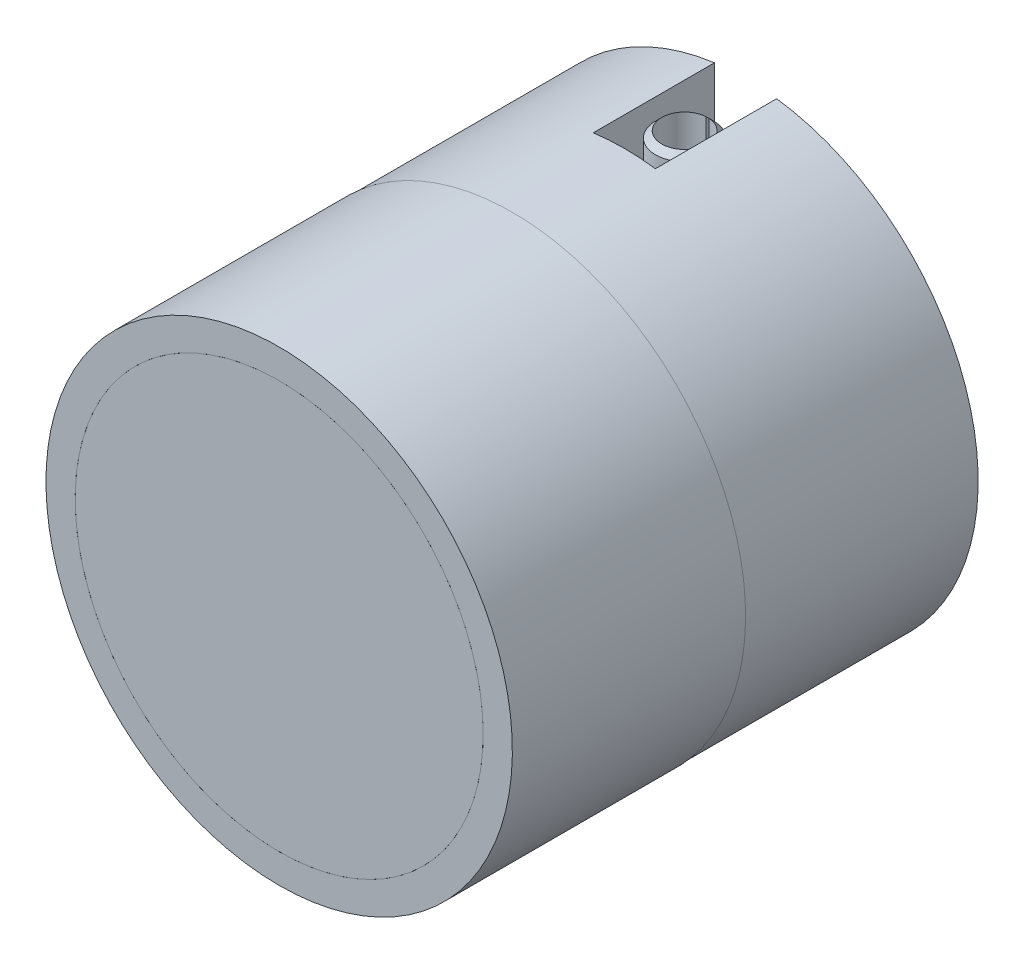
ISO-10303-21;
HEADER;
FILE_DESCRIPTION(('STEP AP214'),'2;1');
FILE_NAME('part.step','',(''),(''),'','','');
FILE_SCHEMA(('AUTOMOTIVE_DESIGN { 1 0 10303 214 1 1 1 1 }'));
ENDSEC;
DATA;
#1=APPLICATION_CONTEXT('core data for automotive mechanical design processes');
#2=APPLICATION_PROTOCOL_DEFINITION('international standard','automotive_design',2000,#1);
#3=PRODUCT_CONTEXT('',#1,'mechanical');
#4=PRODUCT('Part','Part','',(#3));
#5=PRODUCT_RELATED_PRODUCT_CATEGORY('part','',(#4));
#6=PRODUCT_DEFINITION_FORMATION('','',#4);
#7=PRODUCT_DEFINITION_CONTEXT('part definition',#1,'design');
#8=PRODUCT_DEFINITION('design','',#6,#7);
#9=PRODUCT_DEFINITION_SHAPE('','',#8);
#10=(LENGTH_UNIT() NAMED_UNIT(*) SI_UNIT(.MILLI.,.METRE.));
#11=(NAMED_UNIT(*) PLANE_ANGLE_UNIT() SI_UNIT($,.RADIAN.));
#12=(NAMED_UNIT(*) SI_UNIT($,.STERADIAN.) SOLID_ANGLE_UNIT());
#13=UNCERTAINTY_MEASURE_WITH_UNIT(LENGTH_MEASURE(1.E-05),#10,'distance_accuracy_value','');
#14=(GEOMETRIC_REPRESENTATION_CONTEXT(3) GLOBAL_UNCERTAINTY_ASSIGNED_CONTEXT((#13)) GLOBAL_UNIT_ASSIGNED_CONTEXT((#10,
#11,#12)) REPRESENTATION_CONTEXT('',''));
#15=CARTESIAN_POINT('',(0.,0.,0.));
#16=DIRECTION('',(0.,0.,1.));
#17=DIRECTION('',(1.,0.,0.));
#18=AXIS2_PLACEMENT_3D('',#15,#16,#17);
#19=CARTESIAN_POINT('',(0.,0.,0.));
#20=DIRECTION('',(0.,0.,-1.));
#21=DIRECTION('',(0.,1.,0.));
#22=AXIS2_PLACEMENT_3D('',#19,#20,#21);
#23=CYLINDRICAL_SURFACE('',#22,3.556);
#24=CARTESIAN_POINT('',(0.,0.,-4.28397045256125));
#25=DIRECTION('',(0.,0.,1.));
#26=DIRECTION('',(1.,0.,0.));
#27=AXIS2_PLACEMENT_3D('',#24,#25,#26);
#28=CIRCLE('',#27,3.556);
#29=CARTESIAN_POINT('',(3.556,0.,-4.28397045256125));
#30=VERTEX_POINT('',#29);
#31=EDGE_CURVE('P0_E188',#30,#30,#28,.T.);
#32=ORIENTED_EDGE('',*,*,#31,.T.);
#33=EDGE_LOOP('',(#32));
#34=FACE_BOUND('',#33,.T.);
#35=CARTESIAN_POINT('',(0.,0.,-5.334));
#36=DIRECTION('',(0.,0.,-1.));
#37=DIRECTION('',(0.,1.,0.));
#38=AXIS2_PLACEMENT_3D('',#35,#36,#37);
#39=CIRCLE('',#38,3.556);
#40=CARTESIAN_POINT('',(0.,3.556,-5.334));
#41=VERTEX_POINT('',#40);
#42=EDGE_CURVE('P0_E114',#41,#41,#39,.F.);
#43=ORIENTED_EDGE('',*,*,#42,.F.);
#44=EDGE_LOOP('',(#43));
#45=FACE_BOUND('',#44,.T.);
#46=ADVANCED_FACE('P0_F16',(#34,#45),#23,.F.);
#47=CARTESIAN_POINT('',(0.127000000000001,-9.525,-14.097));
#48=DIRECTION('',(0.,0.,1.));
#49=DIRECTION('',(1.,0.,0.));
#50=AXIS2_PLACEMENT_3D('',#47,#48,#49);
#51=PLANE('',#50);
#52=DIRECTION('',(0.,1.,0.));
#53=VECTOR('',#52,1.);
#54=CARTESIAN_POINT('',(1.27,-9.525,-14.097));
#55=LINE('',#54,#53);
#56=CARTESIAN_POINT('',(1.27,6.61010294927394,-14.097));
#57=VERTEX_POINT('',#56);
#58=CARTESIAN_POINT('',(1.27,9.41432420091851,-14.097));
#59=VERTEX_POINT('',#58);
#60=EDGE_CURVE('P0_E137',#57,#59,#55,.T.);
#61=ORIENTED_EDGE('',*,*,#60,.F.);
#62=CARTESIAN_POINT('',(0.,0.,-14.097));
#63=DIRECTION('',(0.,0.,1.));
#64=DIRECTION('',(1.,0.,0.));
#65=AXIS2_PLACEMENT_3D('',#62,#63,#64);
#66=CIRCLE('',#65,6.731);
#67=CARTESIAN_POINT('',(-1.27,6.61010294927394,-14.097));
#68=VERTEX_POINT('',#67);
#69=EDGE_CURVE('P0_E86',#57,#68,#66,.T.);
#70=ORIENTED_EDGE('',*,*,#69,.T.);
#71=DIRECTION('',(0.,1.,0.));
#72=VECTOR('',#71,1.);
#73=CARTESIAN_POINT('',(-1.27,-9.525,-14.097));
#74=LINE('',#73,#72);
#75=CARTESIAN_POINT('',(-1.27,9.4143242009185,-14.097));
#76=VERTEX_POINT('',#75);
#77=EDGE_CURVE('P0_E132',#68,#76,#74,.T.);
#78=ORIENTED_EDGE('',*,*,#77,.T.);
#79=CARTESIAN_POINT('',(0.,0.,-14.097));
#80=DIRECTION('',(0.,0.,1.));
#81=DIRECTION('',(1.,0.,0.));
#82=AXIS2_PLACEMENT_3D('',#79,#80,#81);
#83=CIRCLE('',#82,9.4996);
#84=EDGE_CURVE('P0_E108',#59,#76,#83,.T.);
#85=ORIENTED_EDGE('',*,*,#84,.F.);
#86=EDGE_LOOP('',(#61,#70,#78,#85));
#87=FACE_BOUND('',#86,.T.);
#88=ADVANCED_FACE('P0_F214',(#87),#51,.F.);
#89=CARTESIAN_POINT('',(1.27,-9.525,-21.717));
#90=DIRECTION('',(1.,0.,0.));
#91=DIRECTION('',(0.,0.,-1.));
#92=AXIS2_PLACEMENT_3D('',#89,#90,#91);
#93=PLANE('',#92);
#94=CARTESIAN_POINT('',(1.27,-9.41432420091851,-14.097));
#95=VERTEX_POINT('',#94);
#96=CARTESIAN_POINT('',(1.27,-6.61010294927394,-14.097));
#97=VERTEX_POINT('',#96);
#98=EDGE_CURVE('P0_E133',#95,#97,#55,.T.);
#99=ORIENTED_EDGE('',*,*,#98,.T.);
#100=DIRECTION('',(0.,0.,-1.));
#101=VECTOR('',#100,1.);
#102=CARTESIAN_POINT('',(1.27,-6.61010294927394,-5.334));
#103=LINE('',#102,#101);
#104=CARTESIAN_POINT('',(1.27,-6.61010294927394,-19.05));
#105=VERTEX_POINT('',#104);
#106=EDGE_CURVE('P0_E90',#97,#105,#103,.T.);
#107=ORIENTED_EDGE('',*,*,#106,.T.);
#108=DIRECTION('',(0.,1.,0.));
#109=VECTOR('',#108,1.);
#110=CARTESIAN_POINT('',(1.27,9.4996,-19.05));
#111=LINE('',#110,#109);
#112=CARTESIAN_POINT('',(1.27,-9.41432420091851,-19.05));
#113=VERTEX_POINT('',#112);
#114=EDGE_CURVE('P0_E98',#113,#105,#111,.T.);
#115=ORIENTED_EDGE('',*,*,#114,.F.);
#116=DIRECTION('',(0.,0.,1.));
#117=VECTOR('',#116,1.);
#118=CARTESIAN_POINT('',(1.27,-9.41432420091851,0.));
#119=LINE('',#118,#117);
#120=EDGE_CURVE('P0_E146',#95,#113,#119,.F.);
#121=ORIENTED_EDGE('',*,*,#120,.F.);
#122=EDGE_LOOP('',(#99,#107,#115,#121));
#123=FACE_BOUND('',#122,.T.);
#124=ADVANCED_FACE('P0_F219',(#123),#93,.F.);
#125=CARTESIAN_POINT('',(-1.27,-9.525,-14.097));
#126=DIRECTION('',(-1.,0.,0.));
#127=DIRECTION('',(0.,0.,1.));
#128=AXIS2_PLACEMENT_3D('',#125,#126,#127);
#129=PLANE('',#128);
#130=ORIENTED_EDGE('',*,*,#77,.F.);
#131=DIRECTION('',(0.,0.,-1.));
#132=VECTOR('',#131,1.);
#133=CARTESIAN_POINT('',(-1.27,6.61010294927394,-5.334));
#134=LINE('',#133,#132);
#135=CARTESIAN_POINT('',(-1.27,6.61010294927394,-19.05));
#136=VERTEX_POINT('',#135);
#137=EDGE_CURVE('P0_E129',#68,#136,#134,.T.);
#138=ORIENTED_EDGE('',*,*,#137,.T.);
#139=DIRECTION('',(0.,-1.,0.));
#140=VECTOR('',#139,1.);
#141=CARTESIAN_POINT('',(-1.27,9.4996,-19.05));
#142=LINE('',#141,#140);
#143=CARTESIAN_POINT('',(-1.27,9.41432420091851,-19.05));
#144=VERTEX_POINT('',#143);
#145=EDGE_CURVE('P0_E106',#144,#136,#142,.T.);
#146=ORIENTED_EDGE('',*,*,#145,.F.);
#147=DIRECTION('',(0.,0.,1.));
#148=VECTOR('',#147,1.);
#149=CARTESIAN_POINT('',(-1.27,9.41432420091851,0.));
#150=LINE('',#149,#148);
#151=EDGE_CURVE('P0_E136',#76,#144,#150,.F.);
#152=ORIENTED_EDGE('',*,*,#151,.F.);
#153=EDGE_LOOP('',(#130,#138,#146,#152));
#154=FACE_BOUND('',#153,.T.);
#155=ADVANCED_FACE('P0_F231',(#154),#129,.F.);
#156=CARTESIAN_POINT('',(0.,9.4996,-19.05));
#157=DIRECTION('',(0.,0.,1.));
#158=DIRECTION('',(0.,-1.,0.));
#159=AXIS2_PLACEMENT_3D('',#156,#157,#158);
#160=PLANE('',#159);
#161=ORIENTED_EDGE('',*,*,#114,.T.);
#162=CARTESIAN_POINT('',(0.,0.,-19.05));
#163=DIRECTION('',(0.,0.,-1.));
#164=DIRECTION('',(0.,1.,0.));
#165=AXIS2_PLACEMENT_3D('',#162,#163,#164);
#166=CIRCLE('',#165,6.731);
#167=CARTESIAN_POINT('',(1.27,6.61010294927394,-19.05));
#168=VERTEX_POINT('',#167);
#169=EDGE_CURVE('P0_E83',#168,#105,#166,.T.);
#170=ORIENTED_EDGE('',*,*,#169,.F.);
#171=CARTESIAN_POINT('',(1.27,9.41432420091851,-19.05));
#172=VERTEX_POINT('',#171);
#173=EDGE_CURVE('P0_E96',#168,#172,#111,.T.);
#174=ORIENTED_EDGE('',*,*,#173,.T.);
#175=CARTESIAN_POINT('',(0.,0.,-19.05));
#176=DIRECTION('',(0.,0.,1.));
#177=DIRECTION('',(0.,-1.,0.));
#178=AXIS2_PLACEMENT_3D('',#175,#176,#177);
#179=CIRCLE('',#178,9.4996);
#180=EDGE_CURVE('P0_E160',#113,#172,#179,.T.);
#181=ORIENTED_EDGE('',*,*,#180,.F.);
#182=EDGE_LOOP('',(#161,#170,#174,#181));
#183=FACE_BOUND('',#182,.T.);
#184=ADVANCED_FACE('P0_F94',(#183),#160,.F.);
#185=CARTESIAN_POINT('',(0.,0.,0.));
#186=DIRECTION('',(0.,0.,1.));
#187=DIRECTION('',(0.,-1.,0.));
#188=AXIS2_PLACEMENT_3D('',#185,#186,#187);
#189=CYLINDRICAL_SURFACE('',#188,9.525);
#190=CARTESIAN_POINT('',(0.,0.,0.));
#191=DIRECTION('',(0.,0.,1.));
#192=DIRECTION('',(0.,-1.,0.));
#193=AXIS2_PLACEMENT_3D('',#190,#191,#192);
#194=CIRCLE('',#193,9.525);
#195=CARTESIAN_POINT('',(0.,-9.525,0.));
#196=VERTEX_POINT('',#195);
#197=EDGE_CURVE('P0_E150',#196,#196,#194,.T.);
#198=ORIENTED_EDGE('',*,*,#197,.F.);
#199=EDGE_LOOP('',(#198));
#200=FACE_BOUND('',#199,.T.);
#201=CARTESIAN_POINT('',(0.,0.,-9.525));
#202=DIRECTION('',(0.,0.,1.));
#203=DIRECTION('',(0.,-1.,0.));
#204=AXIS2_PLACEMENT_3D('',#201,#202,#203);
#205=CIRCLE('',#204,9.525);
#206=CARTESIAN_POINT('',(0.,-9.525,-9.525));
#207=VERTEX_POINT('',#206);
#208=EDGE_CURVE('P0_E164',#207,#207,#205,.T.);
#209=ORIENTED_EDGE('',*,*,#208,.T.);
#210=EDGE_LOOP('',(#209));
#211=FACE_BOUND('',#210,.T.);
#212=ADVANCED_FACE('P0_F18',(#200,#211),#189,.T.);
#213=CARTESIAN_POINT('',(0.,9.525,-9.525));
#214=DIRECTION('',(0.,0.,1.));
#215=DIRECTION('',(0.,-1.,0.));
#216=AXIS2_PLACEMENT_3D('',#213,#214,#215);
#217=PLANE('',#216);
#218=ORIENTED_EDGE('',*,*,#208,.F.);
#219=EDGE_LOOP('',(#218));
#220=FACE_BOUND('',#219,.T.);
#221=CARTESIAN_POINT('',(0.,0.,-9.525));
#222=DIRECTION('',(0.,0.,1.));
#223=DIRECTION('',(0.,-1.,0.));
#224=AXIS2_PLACEMENT_3D('',#221,#222,#223);
#225=CIRCLE('',#224,9.4996);
#226=CARTESIAN_POINT('',(0.,-9.4996,-9.525));
#227=VERTEX_POINT('',#226);
#228=EDGE_CURVE('P0_E162',#227,#227,#225,.T.);
#229=ORIENTED_EDGE('',*,*,#228,.T.);
#230=EDGE_LOOP('',(#229));
#231=FACE_BOUND('',#230,.T.);
#232=ADVANCED_FACE('P0_F169',(#220,#231),#217,.F.);
#233=CARTESIAN_POINT('',(0.,0.,0.));
#234=DIRECTION('',(0.,0.,1.));
#235=DIRECTION('',(0.,-1.,0.));
#236=AXIS2_PLACEMENT_3D('',#233,#234,#235);
#237=CYLINDRICAL_SURFACE('',#236,9.4996);
#238=ORIENTED_EDGE('',*,*,#228,.F.);
#239=EDGE_LOOP('',(#238));
#240=FACE_BOUND('',#239,.T.);
#241=CARTESIAN_POINT('',(-1.27,-9.41432420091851,-14.097));
#242=VERTEX_POINT('',#241);
#243=EDGE_CURVE('P0_E24',#242,#95,#83,.T.);
#244=ORIENTED_EDGE('',*,*,#243,.T.);
#245=ORIENTED_EDGE('',*,*,#120,.T.);
#246=ORIENTED_EDGE('',*,*,#180,.T.);
#247=DIRECTION('',(0.,0.,1.));
#248=VECTOR('',#247,1.);
#249=CARTESIAN_POINT('',(1.27,9.41432420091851,0.));
#250=LINE('',#249,#248);
#251=EDGE_CURVE('P0_E104',#172,#59,#250,.T.);
#252=ORIENTED_EDGE('',*,*,#251,.T.);
#253=ORIENTED_EDGE('',*,*,#84,.T.);
#254=ORIENTED_EDGE('',*,*,#151,.T.);
#255=CARTESIAN_POINT('',(-1.27,-9.41432420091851,-19.05));
#256=VERTEX_POINT('',#255);
#257=EDGE_CURVE('P0_E159',#144,#256,#179,.T.);
#258=ORIENTED_EDGE('',*,*,#257,.T.);
#259=DIRECTION('',(0.,0.,1.));
#260=VECTOR('',#259,1.);
#261=CARTESIAN_POINT('',(-1.27,-9.41432420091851,0.));
#262=LINE('',#261,#260);
#263=EDGE_CURVE('P0_E143',#256,#242,#262,.T.);
#264=ORIENTED_EDGE('',*,*,#263,.T.);
#265=EDGE_LOOP('',(#244,#245,#246,#252,#253,#254,#258,#264));
#266=FACE_BOUND('',#265,.T.);
#267=ADVANCED_FACE('P0_F172',(#240,#266),#237,.T.);
#268=ORIENTED_EDGE('',*,*,#145,.T.);
#269=CARTESIAN_POINT('',(-1.27,-6.61010294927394,-19.05));
#270=VERTEX_POINT('',#269);
#271=EDGE_CURVE('P0_E100',#270,#136,#166,.T.);
#272=ORIENTED_EDGE('',*,*,#271,.F.);
#273=EDGE_CURVE('P0_E38',#270,#256,#142,.T.);
#274=ORIENTED_EDGE('',*,*,#273,.T.);
#275=ORIENTED_EDGE('',*,*,#257,.F.);
#276=EDGE_LOOP('',(#268,#272,#274,#275));
#277=FACE_BOUND('',#276,.T.);
#278=ADVANCED_FACE('P0_F177',(#277),#160,.F.);
#279=CARTESIAN_POINT('',(0.,7.31031357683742,-3.81));
#280=DIRECTION('',(0.,0.,-1.));
#281=DIRECTION('',(0.,1.,0.));
#282=AXIS2_PLACEMENT_3D('',#279,#280,#281);
#283=PLANE('',#282);
#284=CARTESIAN_POINT('',(0.,0.,-3.81));
#285=DIRECTION('',(0.,0.,1.));
#286=DIRECTION('',(1.,0.,0.));
#287=AXIS2_PLACEMENT_3D('',#284,#285,#286);
#288=CIRCLE('',#287,3.937);
#289=CARTESIAN_POINT('',(3.937,0.,-3.81));
#290=VERTEX_POINT('',#289);
#291=EDGE_CURVE('P0_E124',#290,#290,#288,.T.);
#292=ORIENTED_EDGE('',*,*,#291,.F.);
#293=EDGE_LOOP('',(#292));
#294=FACE_BOUND('',#293,.T.);
#295=CARTESIAN_POINT('',(0.,0.,-3.81));
#296=DIRECTION('',(0.,0.,1.));
#297=DIRECTION('',(0.,-1.,0.));
#298=AXIS2_PLACEMENT_3D('',#295,#296,#297);
#299=CIRCLE('',#298,7.31031357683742);
#300=CARTESIAN_POINT('',(0.,-7.31031357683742,-3.81));
#301=VERTEX_POINT('',#300);
#302=EDGE_CURVE('P0_E156',#301,#301,#299,.T.);
#303=ORIENTED_EDGE('',*,*,#302,.T.);
#304=EDGE_LOOP('',(#303));
#305=FACE_BOUND('',#304,.T.);
#306=ADVANCED_FACE('P0_F238',(#294,#305),#283,.F.);
#307=CARTESIAN_POINT('',(0.,0.,0.));
#308=DIRECTION('',(0.,0.,1.));
#309=DIRECTION('',(0.,-1.,0.));
#310=AXIS2_PLACEMENT_3D('',#307,#308,#309);
#311=CONICAL_SURFACE('',#310,8.3312,0.26179938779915);
#312=ORIENTED_EDGE('',*,*,#302,.F.);
#313=EDGE_LOOP('',(#312));
#314=FACE_BOUND('',#313,.T.);
#315=CARTESIAN_POINT('',(0.,0.,0.));
#316=DIRECTION('',(0.,0.,1.));
#317=DIRECTION('',(0.,-1.,0.));
#318=AXIS2_PLACEMENT_3D('',#315,#316,#317);
#319=CIRCLE('',#318,8.3312);
#320=CARTESIAN_POINT('',(0.,-8.3312,0.));
#321=VERTEX_POINT('',#320);
#322=EDGE_CURVE('P0_E153',#321,#321,#319,.T.);
#323=ORIENTED_EDGE('',*,*,#322,.T.);
#324=EDGE_LOOP('',(#323));
#325=FACE_BOUND('',#324,.T.);
#326=ADVANCED_FACE('P0_F234',(#314,#325),#311,.F.);
#327=CARTESIAN_POINT('',(0.,8.3312,0.));
#328=DIRECTION('',(0.,0.,-1.));
#329=DIRECTION('',(0.,1.,0.));
#330=AXIS2_PLACEMENT_3D('',#327,#328,#329);
#331=PLANE('',#330);
#332=ORIENTED_EDGE('',*,*,#322,.F.);
#333=EDGE_LOOP('',(#332));
#334=FACE_BOUND('',#333,.T.);
#335=ORIENTED_EDGE('',*,*,#197,.T.);
#336=EDGE_LOOP('',(#335));
#337=FACE_BOUND('',#336,.T.);
#338=ADVANCED_FACE('P0_F228',(#334,#337),#331,.F.);
#339=CARTESIAN_POINT('',(-1.27,-6.61010294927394,-14.097));
#340=VERTEX_POINT('',#339);
#341=EDGE_CURVE('P0_E138',#242,#340,#74,.T.);
#342=ORIENTED_EDGE('',*,*,#341,.T.);
#343=CARTESIAN_POINT('',(0.,0.,-14.097));
#344=DIRECTION('',(0.,0.,1.));
#345=DIRECTION('',(1.,0.,0.));
#346=AXIS2_PLACEMENT_3D('',#343,#344,#345);
#347=CIRCLE('',#346,6.731);
#348=EDGE_CURVE('P0_E31',#340,#97,#347,.T.);
#349=ORIENTED_EDGE('',*,*,#348,.T.);
#350=ORIENTED_EDGE('',*,*,#98,.F.);
#351=ORIENTED_EDGE('',*,*,#243,.F.);
#352=EDGE_LOOP('',(#342,#349,#350,#351));
#353=FACE_BOUND('',#352,.T.);
#354=ADVANCED_FACE('P0_F184',(#353),#51,.F.);
#355=ORIENTED_EDGE('',*,*,#173,.F.);
#356=DIRECTION('',(0.,0.,-1.));
#357=VECTOR('',#356,1.);
#358=CARTESIAN_POINT('',(1.27,6.61010294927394,-5.334));
#359=LINE('',#358,#357);
#360=EDGE_CURVE('P0_E80',#168,#57,#359,.F.);
#361=ORIENTED_EDGE('',*,*,#360,.T.);
#362=ORIENTED_EDGE('',*,*,#60,.T.);
#363=ORIENTED_EDGE('',*,*,#251,.F.);
#364=EDGE_LOOP('',(#355,#361,#362,#363));
#365=FACE_BOUND('',#364,.T.);
#366=ADVANCED_FACE('P0_F102',(#365),#93,.F.);
#367=ORIENTED_EDGE('',*,*,#273,.F.);
#368=DIRECTION('',(0.,0.,-1.));
#369=VECTOR('',#368,1.);
#370=CARTESIAN_POINT('',(-1.27,-6.61010294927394,-5.334));
#371=LINE('',#370,#369);
#372=EDGE_CURVE('P0_E10',#270,#340,#371,.F.);
#373=ORIENTED_EDGE('',*,*,#372,.T.);
#374=ORIENTED_EDGE('',*,*,#341,.F.);
#375=ORIENTED_EDGE('',*,*,#263,.F.);
#376=EDGE_LOOP('',(#367,#373,#374,#375));
#377=FACE_BOUND('',#376,.T.);
#378=ADVANCED_FACE('P0_F186',(#377),#129,.F.);
#379=CARTESIAN_POINT('',(0.,0.,-5.334));
#380=DIRECTION('',(0.,0.,-1.));
#381=DIRECTION('',(0.,1.,0.));
#382=AXIS2_PLACEMENT_3D('',#379,#380,#381);
#383=CYLINDRICAL_SURFACE('',#382,6.731);
#384=CARTESIAN_POINT('',(0.,0.,-5.334));
#385=DIRECTION('',(0.,0.,-1.));
#386=DIRECTION('',(0.,1.,0.));
#387=AXIS2_PLACEMENT_3D('',#384,#385,#386);
#388=CIRCLE('',#387,6.731);
#389=CARTESIAN_POINT('',(0.,6.731,-5.334));
#390=VERTEX_POINT('',#389);
#391=EDGE_CURVE('P0_E99',#390,#390,#388,.T.);
#392=ORIENTED_EDGE('',*,*,#391,.F.);
#393=EDGE_LOOP('',(#392));
#394=FACE_BOUND('',#393,.T.);
#395=ORIENTED_EDGE('',*,*,#69,.F.);
#396=ORIENTED_EDGE('',*,*,#360,.F.);
#397=ORIENTED_EDGE('',*,*,#169,.T.);
#398=ORIENTED_EDGE('',*,*,#106,.F.);
#399=ORIENTED_EDGE('',*,*,#348,.F.);
#400=ORIENTED_EDGE('',*,*,#372,.F.);
#401=ORIENTED_EDGE('',*,*,#271,.T.);
#402=ORIENTED_EDGE('',*,*,#137,.F.);
#403=EDGE_LOOP('',(#395,#396,#397,#398,#399,#400,#401,#402));
#404=FACE_BOUND('',#403,.T.);
#405=ADVANCED_FACE('P0_F82',(#394,#404),#383,.F.);
#406=CARTESIAN_POINT('',(0.,0.,-5.334));
#407=DIRECTION('',(0.,0.,-1.));
#408=DIRECTION('',(0.,1.,0.));
#409=AXIS2_PLACEMENT_3D('',#406,#407,#408);
#410=PLANE('',#409);
#411=ORIENTED_EDGE('',*,*,#391,.T.);
#412=EDGE_LOOP('',(#411));
#413=FACE_BOUND('',#412,.T.);
#414=ORIENTED_EDGE('',*,*,#42,.T.);
#415=EDGE_LOOP('',(#414));
#416=FACE_BOUND('',#415,.T.);
#417=ADVANCED_FACE('P0_F204',(#413,#416),#410,.T.);
#418=CARTESIAN_POINT('',(0.,0.,-4.064));
#419=DIRECTION('',(0.,0.,1.));
#420=DIRECTION('',(1.,0.,0.));
#421=AXIS2_PLACEMENT_3D('',#418,#419,#420);
#422=CYLINDRICAL_SURFACE('',#421,3.937);
#423=CARTESIAN_POINT('',(0.,0.,-4.064));
#424=DIRECTION('',(0.,0.,1.));
#425=DIRECTION('',(1.,0.,0.));
#426=AXIS2_PLACEMENT_3D('',#423,#424,#425);
#427=CIRCLE('',#426,3.937);
#428=CARTESIAN_POINT('',(3.937,0.,-4.064));
#429=VERTEX_POINT('',#428);
#430=EDGE_CURVE('P0_E192',#429,#429,#427,.T.);
#431=ORIENTED_EDGE('',*,*,#430,.F.);
#432=EDGE_LOOP('',(#431));
#433=FACE_BOUND('',#432,.T.);
#434=ORIENTED_EDGE('',*,*,#291,.T.);
#435=EDGE_LOOP('',(#434));
#436=FACE_BOUND('',#435,.T.);
#437=ADVANCED_FACE('P0_F202',(#433,#436),#422,.F.);
#438=CARTESIAN_POINT('',(0.,0.,-4.064));
#439=DIRECTION('',(0.,0.,1.));
#440=DIRECTION('',(1.,0.,0.));
#441=AXIS2_PLACEMENT_3D('',#438,#439,#440);
#442=CONICAL_SURFACE('',#441,3.937,1.0471975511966);
#443=ORIENTED_EDGE('',*,*,#430,.T.);
#444=EDGE_LOOP('',(#443));
#445=FACE_BOUND('',#444,.T.);
#446=ORIENTED_EDGE('',*,*,#31,.F.);
#447=EDGE_LOOP('',(#446));
#448=FACE_BOUND('',#447,.T.);
#449=ADVANCED_FACE('P0_F199',(#445,#448),#442,.F.);
#450=CLOSED_SHELL('',(#46,#88,#124,#155,#184,#212,#232,#267,#278,#306,#326,#338,#354,#366,#378,
#405,#417,#437,#449));
#451=MANIFOLD_SOLID_BREP('P0_B1',#450);
#452=CARTESIAN_POINT('',(0.,8.89,-16.5608));
#453=DIRECTION('',(0.,-1.,0.));
#454=DIRECTION('',(-1.,0.,0.));
#455=AXIS2_PLACEMENT_3D('',#452,#453,#454);
#456=CYLINDRICAL_SURFACE('',#455,1.19126);
#457=DIRECTION('',(0.,-1.,0.));
#458=VECTOR('',#457,1.);
#459=CARTESIAN_POINT('',(-0.0635,8.89,-17.7503663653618));
#460=LINE('',#459,#458);
#461=CARTESIAN_POINT('',(-0.0635,8.636,-17.7503663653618));
#462=VERTEX_POINT('',#461);
#463=CARTESIAN_POINT('',(-0.0635,-8.636,-17.7503663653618));
#464=VERTEX_POINT('',#463);
#465=EDGE_CURVE('P1_E83',#462,#464,#460,.T.);
#466=ORIENTED_EDGE('',*,*,#465,.T.);
#467=CARTESIAN_POINT('',(0.,-8.636,-16.5608));
#468=DIRECTION('',(0.,1.,0.));
#469=DIRECTION('',(1.,0.,0.));
#470=AXIS2_PLACEMENT_3D('',#467,#468,#469);
#471=CIRCLE('',#470,1.19126);
#472=CARTESIAN_POINT('',(0.0635,-8.636,-17.7503663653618));
#473=VERTEX_POINT('',#472);
#474=EDGE_CURVE('P1_E71',#464,#473,#471,.T.);
#475=ORIENTED_EDGE('',*,*,#474,.T.);
#476=DIRECTION('',(0.,-1.,0.));
#477=VECTOR('',#476,1.);
#478=CARTESIAN_POINT('',(0.0635,8.89,-17.7503663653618));
#479=LINE('',#478,#477);
#480=CARTESIAN_POINT('',(0.0635,8.636,-17.7503663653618));
#481=VERTEX_POINT('',#480);
#482=EDGE_CURVE('P1_E78',#481,#473,#479,.T.);
#483=ORIENTED_EDGE('',*,*,#482,.F.);
#484=CARTESIAN_POINT('',(0.,8.636,-16.5608));
#485=DIRECTION('',(0.,1.,0.));
#486=DIRECTION('',(1.,0.,0.));
#487=AXIS2_PLACEMENT_3D('',#484,#485,#486);
#488=CIRCLE('',#487,1.19126);
#489=EDGE_CURVE('P1_E43',#481,#462,#488,.F.);
#490=ORIENTED_EDGE('',*,*,#489,.T.);
#491=EDGE_LOOP('',(#466,#475,#483,#490));
#492=FACE_BOUND('',#491,.T.);
#493=ADVANCED_FACE('P1_F17',(#492),#456,.T.);
#494=CARTESIAN_POINT('',(0.0635,8.89,-17.7503663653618));
#495=DIRECTION('',(1.,0.,0.));
#496=DIRECTION('',(0.,0.,-1.));
#497=AXIS2_PLACEMENT_3D('',#494,#495,#496);
#498=PLANE('',#497);
#499=ORIENTED_EDGE('',*,*,#482,.T.);
#500=CARTESIAN_POINT('',(0.0635,-8.636,-17.7503663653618));
#501=CARTESIAN_POINT('',(0.0635,-8.67834250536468,-17.7079655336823));
#502=CARTESIAN_POINT('',(0.0635,-8.72068042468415,-17.6655601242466));
#503=CARTESIAN_POINT('',(0.0635,-8.80534709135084,-17.5807401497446));
#504=CARTESIAN_POINT('',(0.0635,-8.84767583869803,-17.5383255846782));
#505=CARTESIAN_POINT('',(0.0635,-8.89,-17.4959064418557));
#506=B_SPLINE_CURVE_WITH_KNOTS('',3,(#500,#501,#502,#503,#504,#505),.UNSPECIFIED.,.F.,.F.,(4,2,
4),(0.,0.179767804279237,0.359535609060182),.UNSPECIFIED.);
#507=CARTESIAN_POINT('',(0.0635,-8.89,-17.4959064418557));
#508=VERTEX_POINT('',#507);
#509=EDGE_CURVE('P1_E70',#473,#508,#506,.T.);
#510=ORIENTED_EDGE('',*,*,#509,.T.);
#511=DIRECTION('',(0.,-1.,0.));
#512=VECTOR('',#511,1.);
#513=CARTESIAN_POINT('',(0.0635,8.89,-17.4959064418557));
#514=LINE('',#513,#512);
#515=CARTESIAN_POINT('',(0.0635,8.89,-17.4959064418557));
#516=VERTEX_POINT('',#515);
#517=EDGE_CURVE('P1_E74',#516,#508,#514,.T.);
#518=ORIENTED_EDGE('',*,*,#517,.F.);
#519=CARTESIAN_POINT('',(0.0635,8.89,-17.4959064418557));
#520=CARTESIAN_POINT('',(0.0635,8.84767583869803,-17.5383255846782));
#521=CARTESIAN_POINT('',(0.0635,8.80534709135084,-17.5807401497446));
#522=CARTESIAN_POINT('',(0.0635,8.72068042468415,-17.6655601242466));
#523=CARTESIAN_POINT('',(0.0635,8.67834250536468,-17.7079655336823));
#524=CARTESIAN_POINT('',(0.0635,8.636,-17.7503663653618));
#525=B_SPLINE_CURVE_WITH_KNOTS('',3,(#519,#520,#521,#522,#523,#524),.UNSPECIFIED.,.F.,.F.,(4,2,
4),(0.,0.17976780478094,0.359535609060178),.UNSPECIFIED.);
#526=EDGE_CURVE('P1_E63',#516,#481,#525,.T.);
#527=ORIENTED_EDGE('',*,*,#526,.T.);
#528=EDGE_LOOP('',(#499,#510,#518,#527));
#529=FACE_BOUND('',#528,.T.);
#530=ADVANCED_FACE('P1_F75',(#529),#498,.F.);
#531=CARTESIAN_POINT('',(0.,8.89,-16.5608));
#532=DIRECTION('',(0.,-1.,0.));
#533=DIRECTION('',(-1.,0.,0.));
#534=AXIS2_PLACEMENT_3D('',#531,#532,#533);
#535=CYLINDRICAL_SURFACE('',#534,0.93726);
#536=CARTESIAN_POINT('',(0.,-8.89,-16.5608));
#537=DIRECTION('',(0.,-1.,0.));
#538=DIRECTION('',(1.,0.,0.));
#539=AXIS2_PLACEMENT_3D('',#536,#537,#538);
#540=CIRCLE('',#539,0.93726);
#541=CARTESIAN_POINT('',(-0.0635000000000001,-8.89,-17.4959064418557));
#542=VERTEX_POINT('',#541);
#543=EDGE_CURVE('P1_E84',#508,#542,#540,.T.);
#544=ORIENTED_EDGE('',*,*,#543,.T.);
#545=DIRECTION('',(0.,-1.,0.));
#546=VECTOR('',#545,1.);
#547=CARTESIAN_POINT('',(-0.0635000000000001,8.89,-17.4959064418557));
#548=LINE('',#547,#546);
#549=CARTESIAN_POINT('',(-0.0635000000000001,8.89,-17.4959064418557));
#550=VERTEX_POINT('',#549);
#551=EDGE_CURVE('P1_E79',#550,#542,#548,.T.);
#552=ORIENTED_EDGE('',*,*,#551,.F.);
#553=CARTESIAN_POINT('',(0.,8.89,-16.5608));
#554=DIRECTION('',(0.,-1.,0.));
#555=DIRECTION('',(1.,0.,0.));
#556=AXIS2_PLACEMENT_3D('',#553,#554,#555);
#557=CIRCLE('',#556,0.93726);
#558=EDGE_CURVE('P1_E67',#516,#550,#557,.T.);
#559=ORIENTED_EDGE('',*,*,#558,.F.);
#560=ORIENTED_EDGE('',*,*,#517,.T.);
#561=EDGE_LOOP('',(#544,#552,#559,#560));
#562=FACE_BOUND('',#561,.T.);
#563=ADVANCED_FACE('P1_F82',(#562),#535,.F.);
#564=CARTESIAN_POINT('',(-0.0635,8.89,-17.7503663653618));
#565=DIRECTION('',(-1.,0.,0.));
#566=DIRECTION('',(0.,0.,1.));
#567=AXIS2_PLACEMENT_3D('',#564,#565,#566);
#568=PLANE('',#567);
#569=ORIENTED_EDGE('',*,*,#551,.T.);
#570=CARTESIAN_POINT('',(-0.0635,-8.89,-17.4959064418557));
#571=CARTESIAN_POINT('',(-0.0635,-8.84767583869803,-17.5383255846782));
#572=CARTESIAN_POINT('',(-0.0635,-8.80534709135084,-17.5807401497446));
#573=CARTESIAN_POINT('',(-0.0635,-8.72068042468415,-17.6655601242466));
#574=CARTESIAN_POINT('',(-0.0635,-8.67834250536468,-17.7079655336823));
#575=CARTESIAN_POINT('',(-0.0635,-8.636,-17.7503663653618));
#576=B_SPLINE_CURVE_WITH_KNOTS('',3,(#570,#571,#572,#573,#574,#575),.UNSPECIFIED.,.F.,.F.,(4,2,
4),(0.,0.179767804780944,0.359535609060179),.UNSPECIFIED.);
#577=EDGE_CURVE('P1_E11',#542,#464,#576,.T.);
#578=ORIENTED_EDGE('',*,*,#577,.T.);
#579=ORIENTED_EDGE('',*,*,#465,.F.);
#580=CARTESIAN_POINT('',(-0.0635,8.636,-17.7503663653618));
#581=CARTESIAN_POINT('',(-0.0635,8.67834250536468,-17.7079655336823));
#582=CARTESIAN_POINT('',(-0.0635,8.72068042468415,-17.6655601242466));
#583=CARTESIAN_POINT('',(-0.0635,8.80534709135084,-17.5807401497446));
#584=CARTESIAN_POINT('',(-0.0635,8.84767583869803,-17.5383255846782));
#585=CARTESIAN_POINT('',(-0.0635,8.89,-17.4959064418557));
#586=B_SPLINE_CURVE_WITH_KNOTS('',3,(#580,#581,#582,#583,#584,#585),.UNSPECIFIED.,.F.,.F.,(4,2,
4),(0.,0.179767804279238,0.359535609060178),.UNSPECIFIED.);
#587=EDGE_CURVE('P1_E31',#462,#550,#586,.T.);
#588=ORIENTED_EDGE('',*,*,#587,.T.);
#589=EDGE_LOOP('',(#569,#578,#579,#588));
#590=FACE_BOUND('',#589,.T.);
#591=ADVANCED_FACE('P1_F112',(#590),#568,.F.);
#592=CARTESIAN_POINT('',(0.,-8.636,-16.5608));
#593=DIRECTION('',(0.,1.,0.));
#594=DIRECTION('',(1.,0.,0.));
#595=AXIS2_PLACEMENT_3D('',#592,#593,#594);
#596=CONICAL_SURFACE('',#595,1.19126,0.785398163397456);
#597=ORIENTED_EDGE('',*,*,#577,.F.);
#598=ORIENTED_EDGE('',*,*,#543,.F.);
#599=ORIENTED_EDGE('',*,*,#509,.F.);
#600=ORIENTED_EDGE('',*,*,#474,.F.);
#601=EDGE_LOOP('',(#597,#598,#599,#600));
#602=FACE_BOUND('',#601,.T.);
#603=ADVANCED_FACE('P1_F109',(#602),#596,.T.);
#604=CARTESIAN_POINT('',(0.,8.89,-16.5608));
#605=DIRECTION('',(0.,-1.,0.));
#606=DIRECTION('',(-1.,0.,0.));
#607=AXIS2_PLACEMENT_3D('',#604,#605,#606);
#608=CONICAL_SURFACE('',#607,0.937260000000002,0.785398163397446);
#609=ORIENTED_EDGE('',*,*,#587,.F.);
#610=ORIENTED_EDGE('',*,*,#489,.F.);
#611=ORIENTED_EDGE('',*,*,#526,.F.);
#612=ORIENTED_EDGE('',*,*,#558,.T.);
#613=EDGE_LOOP('',(#609,#610,#611,#612));
#614=FACE_BOUND('',#613,.T.);
#615=ADVANCED_FACE('P1_F19',(#614),#608,.T.);
#616=CLOSED_SHELL('',(#493,#530,#563,#591,#603,#615));
#617=MANIFOLD_SOLID_BREP('P1_B1',#616);
#618=CARTESIAN_POINT('',(5.969,0.,-14.72565));
#619=DIRECTION('',(0.,1.,0.));
#620=DIRECTION('',(0.,0.,1.));
#621=AXIS2_PLACEMENT_3D('',#618,#619,#620);
#622=PLANE('',#621);
#623=CARTESIAN_POINT('',(5.969,0.,-14.72565));
#624=DIRECTION('',(0.,1.,0.));
#625=DIRECTION('',(0.,0.,1.));
#626=AXIS2_PLACEMENT_3D('',#623,#624,#625);
#627=CIRCLE('',#626,0.381000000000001);
#628=CARTESIAN_POINT('',(5.969,0.,-14.34465));
#629=VERTEX_POINT('',#628);
#630=EDGE_CURVE('P2_E24',#629,#629,#627,.T.);
#631=ORIENTED_EDGE('',*,*,#630,.T.);
#632=EDGE_LOOP('',(#631));
#633=FACE_BOUND('',#632,.T.);
#634=ADVANCED_FACE('P2_F17',(#633),#622,.T.);
#635=CARTESIAN_POINT('',(-5.969,4.3357216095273E-13,-5.715));
#636=DIRECTION('',(0.,-1.,0.));
#637=DIRECTION('',(0.,0.,1.));
#638=AXIS2_PLACEMENT_3D('',#635,#636,#637);
#639=PLANE('',#638);
#640=CARTESIAN_POINT('',(-5.969,4.3357216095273E-13,-5.715));
#641=DIRECTION('',(0.,-1.,0.));
#642=DIRECTION('',(0.,0.,1.));
#643=AXIS2_PLACEMENT_3D('',#640,#641,#642);
#644=CIRCLE('',#643,0.381000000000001);
#645=CARTESIAN_POINT('',(-5.969,4.3357216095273E-13,-5.334));
#646=VERTEX_POINT('',#645);
#647=EDGE_CURVE('P2_E11',#646,#646,#644,.T.);
#648=ORIENTED_EDGE('',*,*,#647,.F.);
#649=EDGE_LOOP('',(#648));
#650=FACE_BOUND('',#649,.T.);
#651=ADVANCED_FACE('P2_F33',(#650),#639,.F.);
#652=CARTESIAN_POINT('',(5.969,0.,-14.34465));
#653=CARTESIAN_POINT('',(5.969,-3.44620375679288,-14.208125));
#654=CARTESIAN_POINT('',(2.9845,-5.16930563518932,-14.0716));
#655=CARTESIAN_POINT('',(0.,-6.89240751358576,-13.935075));
#656=CARTESIAN_POINT('',(-2.9845,-5.16930563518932,-13.79855));
#657=CARTESIAN_POINT('',(-5.969,-3.44620375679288,-13.662025));
#658=CARTESIAN_POINT('',(-5.969,0.,-13.5255));
#659=CARTESIAN_POINT('',(-5.969,3.44620375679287,-13.388975));
#660=CARTESIAN_POINT('',(-2.9845,5.16930563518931,-13.25245));
#661=CARTESIAN_POINT('',(0.,6.89240751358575,-13.115925));
#662=CARTESIAN_POINT('',(2.9845,5.16930563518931,-12.9794));
#663=CARTESIAN_POINT('',(5.969,3.44620375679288,-12.842875));
#664=CARTESIAN_POINT('',(5.969,0.,-12.70635));
#665=CARTESIAN_POINT('',(5.969,-3.44620375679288,-12.569825));
#666=CARTESIAN_POINT('',(2.9845,-5.16930563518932,-12.4333));
#667=CARTESIAN_POINT('',(0.,-6.89240751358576,-12.296775));
#668=CARTESIAN_POINT('',(-2.9845,-5.16930563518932,-12.16025));
#669=CARTESIAN_POINT('',(-5.969,-3.44620375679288,-12.023725));
#670=CARTESIAN_POINT('',(-5.969,0.,-11.8872));
#671=CARTESIAN_POINT('',(-5.969,3.44620375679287,-11.750675));
#672=CARTESIAN_POINT('',(-2.9845,5.16930563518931,-11.61415));
#673=CARTESIAN_POINT('',(0.,6.89240751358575,-11.477625));
#674=CARTESIAN_POINT('',(2.9845,5.16930563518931,-11.3411));
#675=CARTESIAN_POINT('',(5.969,3.44620375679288,-11.204575));
#676=CARTESIAN_POINT('',(5.969,0.,-11.06805));
#677=CARTESIAN_POINT('',(5.969,-3.44620375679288,-10.931525));
#678=CARTESIAN_POINT('',(2.9845,-5.16930563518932,-10.795));
#679=CARTESIAN_POINT('',(0.,-6.89240751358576,-10.658475));
#680=CARTESIAN_POINT('',(-2.9845,-5.16930563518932,-10.52195));
#681=CARTESIAN_POINT('',(-5.969,-3.44620375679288,-10.385425));
#682=CARTESIAN_POINT('',(-5.969,0.,-10.2489));
#683=CARTESIAN_POINT('',(-5.969,3.44620375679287,-10.112375));
#684=CARTESIAN_POINT('',(-2.9845,5.16930563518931,-9.97585000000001));
#685=CARTESIAN_POINT('',(0.,6.89240751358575,-9.83932500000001));
#686=CARTESIAN_POINT('',(2.9845,5.16930563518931,-9.70280000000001));
#687=CARTESIAN_POINT('',(5.969,3.44620375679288,-9.56627500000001));
#688=CARTESIAN_POINT('',(5.969,0.,-9.42975000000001));
#689=CARTESIAN_POINT('',(5.969,-3.44620375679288,-9.29322500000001));
#690=CARTESIAN_POINT('',(2.9845,-5.16930563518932,-9.15670000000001));
#691=CARTESIAN_POINT('',(0.,-6.89240751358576,-9.02017500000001));
#692=CARTESIAN_POINT('',(-2.9845,-5.16930563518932,-8.88365000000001));
#693=CARTESIAN_POINT('',(-5.969,-3.44620375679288,-8.74712500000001));
#694=CARTESIAN_POINT('',(-5.969,0.,-8.61060000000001));
#695=CARTESIAN_POINT('',(-5.969,3.44620375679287,-8.47407500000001));
#696=CARTESIAN_POINT('',(-2.9845,5.16930563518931,-8.33755000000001));
#697=CARTESIAN_POINT('',(0.,6.89240751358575,-8.20102500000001));
#698=CARTESIAN_POINT('',(2.9845,5.16930563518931,-8.06450000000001));
#699=CARTESIAN_POINT('',(5.969,3.44620375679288,-7.92797500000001));
#700=CARTESIAN_POINT('',(5.969,0.,-7.79145000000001));
#701=CARTESIAN_POINT('',(5.969,-3.44620375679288,-7.65492500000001));
#702=CARTESIAN_POINT('',(2.9845,-5.16930563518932,-7.51840000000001));
#703=CARTESIAN_POINT('',(0.,-6.89240751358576,-7.38187500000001));
#704=CARTESIAN_POINT('',(-2.9845,-5.16930563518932,-7.24535000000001));
#705=CARTESIAN_POINT('',(-5.969,-3.44620375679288,-7.10882500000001));
#706=CARTESIAN_POINT('',(-5.969,0.,-6.97230000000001));
#707=CARTESIAN_POINT('',(-5.969,3.44620375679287,-6.83577500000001));
#708=CARTESIAN_POINT('',(-2.9845,5.16930563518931,-6.69925000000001));
#709=CARTESIAN_POINT('',(0.,6.89240751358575,-6.56272500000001));
#710=CARTESIAN_POINT('',(2.9845,5.16930563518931,-6.42620000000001));
#711=CARTESIAN_POINT('',(5.969,3.44620375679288,-6.28967500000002));
#712=CARTESIAN_POINT('',(5.969,0.,-6.15315000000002));
#713=CARTESIAN_POINT('',(5.969,-3.44620375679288,-6.01662500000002));
#714=CARTESIAN_POINT('',(2.9845,-5.16930563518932,-5.88010000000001));
#715=CARTESIAN_POINT('',(0.,-6.89240751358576,-5.74357500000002));
#716=CARTESIAN_POINT('',(-2.9845,-5.16930563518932,-5.60705000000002));
#717=CARTESIAN_POINT('',(-5.969,-3.44620375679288,-5.47052500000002));
#718=CARTESIAN_POINT('',(-5.969,0.,-5.33400000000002));
#719=CARTESIAN_POINT('',(-5.969,3.44620375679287,-5.19747500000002));
#720=CARTESIAN_POINT('',(-2.9845,5.16930563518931,-5.06095000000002));
#721=CARTESIAN_POINT('',(0.,6.89240751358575,-4.92442500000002));
#722=CARTESIAN_POINT('',(2.9845,5.16930563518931,-4.78790000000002));
#723=CARTESIAN_POINT('',(5.969,3.44620375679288,-4.65137500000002));
#724=CARTESIAN_POINT('',(5.969,0.,-4.51485000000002));
#725=CARTESIAN_POINT('',(6.731,0.,-14.34465));
#726=CARTESIAN_POINT('',(6.731,-3.88614466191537,-14.208125));
#727=CARTESIAN_POINT('',(3.3655,-5.82921699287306,-14.0716));
#728=CARTESIAN_POINT('',(0.,-7.77228932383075,-13.935075));
#729=CARTESIAN_POINT('',(-3.3655,-5.82921699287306,-13.79855));
#730=CARTESIAN_POINT('',(-6.731,-3.88614466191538,-13.662025));
#731=CARTESIAN_POINT('',(-6.731,0.,-13.5255));
#732=CARTESIAN_POINT('',(-6.731,3.88614466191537,-13.388975));
#733=CARTESIAN_POINT('',(-3.3655,5.82921699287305,-13.25245));
#734=CARTESIAN_POINT('',(0.,7.77228932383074,-13.115925));
#735=CARTESIAN_POINT('',(3.3655,5.82921699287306,-12.9794));
#736=CARTESIAN_POINT('',(6.731,3.88614466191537,-12.842875));
#737=CARTESIAN_POINT('',(6.731,0.,-12.70635));
#738=CARTESIAN_POINT('',(6.731,-3.88614466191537,-12.569825));
#739=CARTESIAN_POINT('',(3.3655,-5.82921699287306,-12.4333));
#740=CARTESIAN_POINT('',(0.,-7.77228932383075,-12.296775));
#741=CARTESIAN_POINT('',(-3.3655,-5.82921699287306,-12.16025));
#742=CARTESIAN_POINT('',(-6.731,-3.88614466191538,-12.023725));
#743=CARTESIAN_POINT('',(-6.731,0.,-11.8872));
#744=CARTESIAN_POINT('',(-6.731,3.88614466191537,-11.750675));
#745=CARTESIAN_POINT('',(-3.3655,5.82921699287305,-11.61415));
#746=CARTESIAN_POINT('',(0.,7.77228932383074,-11.477625));
#747=CARTESIAN_POINT('',(3.3655,5.82921699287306,-11.3411));
#748=CARTESIAN_POINT('',(6.731,3.88614466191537,-11.204575));
#749=CARTESIAN_POINT('',(6.731,0.,-11.06805));
#750=CARTESIAN_POINT('',(6.731,-3.88614466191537,-10.931525));
#751=CARTESIAN_POINT('',(3.3655,-5.82921699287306,-10.795));
#752=CARTESIAN_POINT('',(0.,-7.77228932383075,-10.658475));
#753=CARTESIAN_POINT('',(-3.3655,-5.82921699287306,-10.52195));
#754=CARTESIAN_POINT('',(-6.731,-3.88614466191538,-10.385425));
#755=CARTESIAN_POINT('',(-6.731,0.,-10.2489));
#756=CARTESIAN_POINT('',(-6.731,3.88614466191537,-10.112375));
#757=CARTESIAN_POINT('',(-3.3655,5.82921699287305,-9.97585000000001));
#758=CARTESIAN_POINT('',(0.,7.77228932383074,-9.83932500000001));
#759=CARTESIAN_POINT('',(3.3655,5.82921699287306,-9.70280000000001));
#760=CARTESIAN_POINT('',(6.731,3.88614466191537,-9.56627500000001));
#761=CARTESIAN_POINT('',(6.731,0.,-9.42975000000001));
#762=CARTESIAN_POINT('',(6.731,-3.88614466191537,-9.29322500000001));
#763=CARTESIAN_POINT('',(3.3655,-5.82921699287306,-9.15670000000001));
#764=CARTESIAN_POINT('',(0.,-7.77228932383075,-9.02017500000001));
#765=CARTESIAN_POINT('',(-3.3655,-5.82921699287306,-8.88365000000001));
#766=CARTESIAN_POINT('',(-6.731,-3.88614466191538,-8.74712500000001));
#767=CARTESIAN_POINT('',(-6.731,0.,-8.61060000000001));
#768=CARTESIAN_POINT('',(-6.731,3.88614466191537,-8.47407500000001));
#769=CARTESIAN_POINT('',(-3.3655,5.82921699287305,-8.33755000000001));
#770=CARTESIAN_POINT('',(0.,7.77228932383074,-8.20102500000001));
#771=CARTESIAN_POINT('',(3.3655,5.82921699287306,-8.06450000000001));
#772=CARTESIAN_POINT('',(6.731,3.88614466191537,-7.92797500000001));
#773=CARTESIAN_POINT('',(6.731,0.,-7.79145000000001));
#774=CARTESIAN_POINT('',(6.731,-3.88614466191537,-7.65492500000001));
#775=CARTESIAN_POINT('',(3.3655,-5.82921699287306,-7.51840000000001));
#776=CARTESIAN_POINT('',(0.,-7.77228932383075,-7.38187500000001));
#777=CARTESIAN_POINT('',(-3.3655,-5.82921699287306,-7.24535000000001));
#778=CARTESIAN_POINT('',(-6.731,-3.88614466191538,-7.10882500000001));
#779=CARTESIAN_POINT('',(-6.731,0.,-6.97230000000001));
#780=CARTESIAN_POINT('',(-6.731,3.88614466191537,-6.83577500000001));
#781=CARTESIAN_POINT('',(-3.3655,5.82921699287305,-6.69925000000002));
#782=CARTESIAN_POINT('',(0.,7.77228932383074,-6.56272500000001));
#783=CARTESIAN_POINT('',(3.3655,5.82921699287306,-6.42620000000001));
#784=CARTESIAN_POINT('',(6.731,3.88614466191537,-6.28967500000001));
#785=CARTESIAN_POINT('',(6.731,0.,-6.15315000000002));
#786=CARTESIAN_POINT('',(6.731,-3.88614466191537,-6.01662500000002));
#787=CARTESIAN_POINT('',(3.3655,-5.82921699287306,-5.88010000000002));
#788=CARTESIAN_POINT('',(0.,-7.77228932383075,-5.74357500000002));
#789=CARTESIAN_POINT('',(-3.3655,-5.82921699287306,-5.60705000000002));
#790=CARTESIAN_POINT('',(-6.731,-3.88614466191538,-5.47052500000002));
#791=CARTESIAN_POINT('',(-6.731,0.,-5.33400000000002));
#792=CARTESIAN_POINT('',(-6.731,3.88614466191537,-5.19747500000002));
#793=CARTESIAN_POINT('',(-3.3655,5.82921699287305,-5.06095000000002));
#794=CARTESIAN_POINT('',(0.,7.77228932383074,-4.92442500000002));
#795=CARTESIAN_POINT('',(3.3655,5.82921699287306,-4.78790000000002));
#796=CARTESIAN_POINT('',(6.731,3.88614466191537,-4.65137500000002));
#797=CARTESIAN_POINT('',(6.731,0.,-4.51485000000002));
#798=CARTESIAN_POINT('',(6.731,0.,-15.10665));
#799=CARTESIAN_POINT('',(6.731,-3.88614466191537,-14.970125));
#800=CARTESIAN_POINT('',(3.3655,-5.82921699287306,-14.8336));
#801=CARTESIAN_POINT('',(0.,-7.77228932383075,-14.697075));
#802=CARTESIAN_POINT('',(-3.3655,-5.82921699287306,-14.56055));
#803=CARTESIAN_POINT('',(-6.731,-3.88614466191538,-14.424025));
#804=CARTESIAN_POINT('',(-6.731,0.,-14.2875));
#805=CARTESIAN_POINT('',(-6.731,3.88614466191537,-14.150975));
#806=CARTESIAN_POINT('',(-3.3655,5.82921699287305,-14.01445));
#807=CARTESIAN_POINT('',(0.,7.77228932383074,-13.877925));
#808=CARTESIAN_POINT('',(3.3655,5.82921699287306,-13.7414));
#809=CARTESIAN_POINT('',(6.731,3.88614466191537,-13.604875));
#810=CARTESIAN_POINT('',(6.731,0.,-13.46835));
#811=CARTESIAN_POINT('',(6.731,-3.88614466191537,-13.331825));
#812=CARTESIAN_POINT('',(3.3655,-5.82921699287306,-13.1953));
#813=CARTESIAN_POINT('',(0.,-7.77228932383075,-13.058775));
#814=CARTESIAN_POINT('',(-3.3655,-5.82921699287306,-12.92225));
#815=CARTESIAN_POINT('',(-6.731,-3.88614466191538,-12.785725));
#816=CARTESIAN_POINT('',(-6.731,0.,-12.6492));
#817=CARTESIAN_POINT('',(-6.731,3.88614466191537,-12.512675));
#818=CARTESIAN_POINT('',(-3.3655,5.82921699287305,-12.37615));
#819=CARTESIAN_POINT('',(0.,7.77228932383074,-12.239625));
#820=CARTESIAN_POINT('',(3.3655,5.82921699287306,-12.1031));
#821=CARTESIAN_POINT('',(6.731,3.88614466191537,-11.966575));
#822=CARTESIAN_POINT('',(6.731,0.,-11.83005));
#823=CARTESIAN_POINT('',(6.731,-3.88614466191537,-11.693525));
#824=CARTESIAN_POINT('',(3.3655,-5.82921699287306,-11.557));
#825=CARTESIAN_POINT('',(0.,-7.77228932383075,-11.420475));
#826=CARTESIAN_POINT('',(-3.3655,-5.82921699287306,-11.28395));
#827=CARTESIAN_POINT('',(-6.731,-3.88614466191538,-11.147425));
#828=CARTESIAN_POINT('',(-6.731,0.,-11.0109));
#829=CARTESIAN_POINT('',(-6.731,3.88614466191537,-10.874375));
#830=CARTESIAN_POINT('',(-3.3655,5.82921699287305,-10.73785));
#831=CARTESIAN_POINT('',(0.,7.77228932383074,-10.601325));
#832=CARTESIAN_POINT('',(3.3655,5.82921699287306,-10.4648));
#833=CARTESIAN_POINT('',(6.731,3.88614466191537,-10.328275));
#834=CARTESIAN_POINT('',(6.731,0.,-10.19175));
#835=CARTESIAN_POINT('',(6.731,-3.88614466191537,-10.055225));
#836=CARTESIAN_POINT('',(3.3655,-5.82921699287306,-9.91870000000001));
#837=CARTESIAN_POINT('',(0.,-7.77228932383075,-9.78217500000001));
#838=CARTESIAN_POINT('',(-3.3655,-5.82921699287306,-9.64565000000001));
#839=CARTESIAN_POINT('',(-6.731,-3.88614466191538,-9.50912500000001));
#840=CARTESIAN_POINT('',(-6.731,0.,-9.37260000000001));
#841=CARTESIAN_POINT('',(-6.731,3.88614466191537,-9.23607500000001));
#842=CARTESIAN_POINT('',(-3.3655,5.82921699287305,-9.09955000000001));
#843=CARTESIAN_POINT('',(0.,7.77228932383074,-8.96302500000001));
#844=CARTESIAN_POINT('',(3.3655,5.82921699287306,-8.82650000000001));
#845=CARTESIAN_POINT('',(6.731,3.88614466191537,-8.68997500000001));
#846=CARTESIAN_POINT('',(6.731,0.,-8.55345000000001));
#847=CARTESIAN_POINT('',(6.731,-3.88614466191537,-8.41692500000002));
#848=CARTESIAN_POINT('',(3.3655,-5.82921699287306,-8.28040000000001));
#849=CARTESIAN_POINT('',(0.,-7.77228932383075,-8.14387500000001));
#850=CARTESIAN_POINT('',(-3.3655,-5.82921699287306,-8.00735000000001));
#851=CARTESIAN_POINT('',(-6.731,-3.88614466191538,-7.87082500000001));
#852=CARTESIAN_POINT('',(-6.731,0.,-7.73430000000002));
#853=CARTESIAN_POINT('',(-6.731,3.88614466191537,-7.59777500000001));
#854=CARTESIAN_POINT('',(-3.3655,5.82921699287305,-7.46125000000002));
#855=CARTESIAN_POINT('',(0.,7.77228932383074,-7.32472500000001));
#856=CARTESIAN_POINT('',(3.3655,5.82921699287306,-7.18820000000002));
#857=CARTESIAN_POINT('',(6.731,3.88614466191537,-7.05167500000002));
#858=CARTESIAN_POINT('',(6.731,0.,-6.91515000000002));
#859=CARTESIAN_POINT('',(6.731,-3.88614466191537,-6.77862500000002));
#860=CARTESIAN_POINT('',(3.3655,-5.82921699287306,-6.64210000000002));
#861=CARTESIAN_POINT('',(0.,-7.77228932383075,-6.50557500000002));
#862=CARTESIAN_POINT('',(-3.3655,-5.82921699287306,-6.36905000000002));
#863=CARTESIAN_POINT('',(-6.731,-3.88614466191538,-6.23252500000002));
#864=CARTESIAN_POINT('',(-6.731,0.,-6.09600000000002));
#865=CARTESIAN_POINT('',(-6.731,3.88614466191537,-5.95947500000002));
#866=CARTESIAN_POINT('',(-3.3655,5.82921699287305,-5.82295000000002));
#867=CARTESIAN_POINT('',(0.,7.77228932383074,-5.68642500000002));
#868=CARTESIAN_POINT('',(3.3655,5.82921699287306,-5.54990000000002));
#869=CARTESIAN_POINT('',(6.731,3.88614466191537,-5.41337500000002));
#870=CARTESIAN_POINT('',(6.731,0.,-5.27685000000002));
#871=CARTESIAN_POINT('',(5.969,0.,-15.10665));
#872=CARTESIAN_POINT('',(5.969,-3.44620375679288,-14.970125));
#873=CARTESIAN_POINT('',(2.9845,-5.16930563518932,-14.8336));
#874=CARTESIAN_POINT('',(0.,-6.89240751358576,-14.697075));
#875=CARTESIAN_POINT('',(-2.9845,-5.16930563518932,-14.56055));
#876=CARTESIAN_POINT('',(-5.969,-3.44620375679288,-14.424025));
#877=CARTESIAN_POINT('',(-5.969,0.,-14.2875));
#878=CARTESIAN_POINT('',(-5.969,3.44620375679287,-14.150975));
#879=CARTESIAN_POINT('',(-2.9845,5.16930563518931,-14.01445));
#880=CARTESIAN_POINT('',(0.,6.89240751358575,-13.877925));
#881=CARTESIAN_POINT('',(2.9845,5.16930563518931,-13.7414));
#882=CARTESIAN_POINT('',(5.969,3.44620375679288,-13.604875));
#883=CARTESIAN_POINT('',(5.969,0.,-13.46835));
#884=CARTESIAN_POINT('',(5.969,-3.44620375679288,-13.331825));
#885=CARTESIAN_POINT('',(2.9845,-5.16930563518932,-13.1953));
#886=CARTESIAN_POINT('',(0.,-6.89240751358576,-13.058775));
#887=CARTESIAN_POINT('',(-2.9845,-5.16930563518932,-12.92225));
#888=CARTESIAN_POINT('',(-5.969,-3.44620375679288,-12.785725));
#889=CARTESIAN_POINT('',(-5.969,0.,-12.6492));
#890=CARTESIAN_POINT('',(-5.969,3.44620375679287,-12.512675));
#891=CARTESIAN_POINT('',(-2.9845,5.16930563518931,-12.37615));
#892=CARTESIAN_POINT('',(0.,6.89240751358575,-12.239625));
#893=CARTESIAN_POINT('',(2.9845,5.16930563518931,-12.1031));
#894=CARTESIAN_POINT('',(5.969,3.44620375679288,-11.966575));
#895=CARTESIAN_POINT('',(5.969,0.,-11.83005));
#896=CARTESIAN_POINT('',(5.969,-3.44620375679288,-11.693525));
#897=CARTESIAN_POINT('',(2.9845,-5.16930563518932,-11.557));
#898=CARTESIAN_POINT('',(0.,-6.89240751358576,-11.420475));
#899=CARTESIAN_POINT('',(-2.9845,-5.16930563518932,-11.28395));
#900=CARTESIAN_POINT('',(-5.969,-3.44620375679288,-11.147425));
#901=CARTESIAN_POINT('',(-5.969,0.,-11.0109));
#902=CARTESIAN_POINT('',(-5.969,3.44620375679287,-10.874375));
#903=CARTESIAN_POINT('',(-2.9845,5.16930563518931,-10.73785));
#904=CARTESIAN_POINT('',(0.,6.89240751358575,-10.601325));
#905=CARTESIAN_POINT('',(2.9845,5.16930563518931,-10.4648));
#906=CARTESIAN_POINT('',(5.969,3.44620375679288,-10.328275));
#907=CARTESIAN_POINT('',(5.969,0.,-10.19175));
#908=CARTESIAN_POINT('',(5.969,-3.44620375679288,-10.055225));
#909=CARTESIAN_POINT('',(2.9845,-5.16930563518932,-9.91870000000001));
#910=CARTESIAN_POINT('',(0.,-6.89240751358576,-9.78217500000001));
#911=CARTESIAN_POINT('',(-2.9845,-5.16930563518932,-9.64565000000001));
#912=CARTESIAN_POINT('',(-5.969,-3.44620375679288,-9.50912500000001));
#913=CARTESIAN_POINT('',(-5.969,0.,-9.37260000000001));
#914=CARTESIAN_POINT('',(-5.969,3.44620375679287,-9.23607500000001));
#915=CARTESIAN_POINT('',(-2.9845,5.16930563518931,-9.09955000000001));
#916=CARTESIAN_POINT('',(0.,6.89240751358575,-8.96302500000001));
#917=CARTESIAN_POINT('',(2.9845,5.16930563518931,-8.82650000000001));
#918=CARTESIAN_POINT('',(5.969,3.44620375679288,-8.68997500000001));
#919=CARTESIAN_POINT('',(5.969,0.,-8.55345000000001));
#920=CARTESIAN_POINT('',(5.969,-3.44620375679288,-8.41692500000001));
#921=CARTESIAN_POINT('',(2.9845,-5.16930563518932,-8.28040000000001));
#922=CARTESIAN_POINT('',(0.,-6.89240751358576,-8.14387500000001));
#923=CARTESIAN_POINT('',(-2.9845,-5.16930563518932,-8.00735000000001));
#924=CARTESIAN_POINT('',(-5.969,-3.44620375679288,-7.87082500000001));
#925=CARTESIAN_POINT('',(-5.969,0.,-7.73430000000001));
#926=CARTESIAN_POINT('',(-5.969,3.44620375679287,-7.59777500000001));
#927=CARTESIAN_POINT('',(-2.9845,5.16930563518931,-7.46125000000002));
#928=CARTESIAN_POINT('',(0.,6.89240751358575,-7.32472500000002));
#929=CARTESIAN_POINT('',(2.9845,5.16930563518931,-7.18820000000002));
#930=CARTESIAN_POINT('',(5.969,3.44620375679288,-7.05167500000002));
#931=CARTESIAN_POINT('',(5.969,0.,-6.91515000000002));
#932=CARTESIAN_POINT('',(5.969,-3.44620375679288,-6.77862500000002));
#933=CARTESIAN_POINT('',(2.9845,-5.16930563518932,-6.64210000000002));
#934=CARTESIAN_POINT('',(0.,-6.89240751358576,-6.50557500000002));
#935=CARTESIAN_POINT('',(-2.9845,-5.16930563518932,-6.36905000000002));
#936=CARTESIAN_POINT('',(-5.969,-3.44620375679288,-6.23252500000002));
#937=CARTESIAN_POINT('',(-5.969,0.,-6.09600000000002));
#938=CARTESIAN_POINT('',(-5.969,3.44620375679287,-5.95947500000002));
#939=CARTESIAN_POINT('',(-2.9845,5.16930563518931,-5.82295000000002));
#940=CARTESIAN_POINT('',(0.,6.89240751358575,-5.68642500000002));
#941=CARTESIAN_POINT('',(2.9845,5.16930563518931,-5.54990000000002));
#942=CARTESIAN_POINT('',(5.969,3.44620375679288,-5.41337500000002));
#943=CARTESIAN_POINT('',(5.969,0.,-5.27685000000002));
#944=CARTESIAN_POINT('',(5.207,0.,-15.10665));
#945=CARTESIAN_POINT('',(5.207,-3.00626285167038,-14.970125));
#946=CARTESIAN_POINT('',(2.6035,-4.50939427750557,-14.8336));
#947=CARTESIAN_POINT('',(0.,-6.01252570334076,-14.697075));
#948=CARTESIAN_POINT('',(-2.6035,-4.50939427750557,-14.56055));
#949=CARTESIAN_POINT('',(-5.207,-3.00626285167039,-14.424025));
#950=CARTESIAN_POINT('',(-5.207,0.,-14.2875));
#951=CARTESIAN_POINT('',(-5.207,3.00626285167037,-14.150975));
#952=CARTESIAN_POINT('',(-2.6035,4.50939427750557,-14.01445));
#953=CARTESIAN_POINT('',(0.,6.01252570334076,-13.877925));
#954=CARTESIAN_POINT('',(2.6035,4.50939427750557,-13.7414));
#955=CARTESIAN_POINT('',(5.207,3.00626285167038,-13.604875));
#956=CARTESIAN_POINT('',(5.207,0.,-13.46835));
#957=CARTESIAN_POINT('',(5.207,-3.00626285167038,-13.331825));
#958=CARTESIAN_POINT('',(2.6035,-4.50939427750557,-13.1953));
#959=CARTESIAN_POINT('',(0.,-6.01252570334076,-13.058775));
#960=CARTESIAN_POINT('',(-2.6035,-4.50939427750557,-12.92225));
#961=CARTESIAN_POINT('',(-5.207,-3.00626285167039,-12.785725));
#962=CARTESIAN_POINT('',(-5.207,0.,-12.6492));
#963=CARTESIAN_POINT('',(-5.207,3.00626285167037,-12.512675));
#964=CARTESIAN_POINT('',(-2.6035,4.50939427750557,-12.37615));
#965=CARTESIAN_POINT('',(0.,6.01252570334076,-12.239625));
#966=CARTESIAN_POINT('',(2.6035,4.50939427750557,-12.1031));
#967=CARTESIAN_POINT('',(5.207,3.00626285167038,-11.966575));
#968=CARTESIAN_POINT('',(5.207,0.,-11.83005));
#969=CARTESIAN_POINT('',(5.207,-3.00626285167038,-11.693525));
#970=CARTESIAN_POINT('',(2.6035,-4.50939427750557,-11.557));
#971=CARTESIAN_POINT('',(0.,-6.01252570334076,-11.420475));
#972=CARTESIAN_POINT('',(-2.6035,-4.50939427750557,-11.28395));
#973=CARTESIAN_POINT('',(-5.207,-3.00626285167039,-11.147425));
#974=CARTESIAN_POINT('',(-5.207,0.,-11.0109));
#975=CARTESIAN_POINT('',(-5.207,3.00626285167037,-10.874375));
#976=CARTESIAN_POINT('',(-2.6035,4.50939427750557,-10.73785));
#977=CARTESIAN_POINT('',(0.,6.01252570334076,-10.601325));
#978=CARTESIAN_POINT('',(2.6035,4.50939427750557,-10.4648));
#979=CARTESIAN_POINT('',(5.207,3.00626285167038,-10.328275));
#980=CARTESIAN_POINT('',(5.207,0.,-10.19175));
#981=CARTESIAN_POINT('',(5.207,-3.00626285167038,-10.055225));
#982=CARTESIAN_POINT('',(2.6035,-4.50939427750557,-9.91870000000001));
#983=CARTESIAN_POINT('',(0.,-6.01252570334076,-9.78217500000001));
#984=CARTESIAN_POINT('',(-2.6035,-4.50939427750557,-9.64565000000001));
#985=CARTESIAN_POINT('',(-5.207,-3.00626285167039,-9.50912500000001));
#986=CARTESIAN_POINT('',(-5.207,0.,-9.37260000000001));
#987=CARTESIAN_POINT('',(-5.207,3.00626285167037,-9.23607500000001));
#988=CARTESIAN_POINT('',(-2.6035,4.50939427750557,-9.09955000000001));
#989=CARTESIAN_POINT('',(0.,6.01252570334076,-8.96302500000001));
#990=CARTESIAN_POINT('',(2.6035,4.50939427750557,-8.82650000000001));
#991=CARTESIAN_POINT('',(5.207,3.00626285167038,-8.68997500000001));
#992=CARTESIAN_POINT('',(5.207,0.,-8.55345000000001));
#993=CARTESIAN_POINT('',(5.207,-3.00626285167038,-8.41692500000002));
#994=CARTESIAN_POINT('',(2.6035,-4.50939427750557,-8.28040000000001));
#995=CARTESIAN_POINT('',(0.,-6.01252570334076,-8.14387500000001));
#996=CARTESIAN_POINT('',(-2.6035,-4.50939427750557,-8.00735000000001));
#997=CARTESIAN_POINT('',(-5.207,-3.00626285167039,-7.87082500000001));
#998=CARTESIAN_POINT('',(-5.207,0.,-7.73430000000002));
#999=CARTESIAN_POINT('',(-5.207,3.00626285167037,-7.59777500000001));
#1000=CARTESIAN_POINT('',(-2.6035,4.50939427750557,-7.46125000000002));
#1001=CARTESIAN_POINT('',(0.,6.01252570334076,-7.32472500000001));
#1002=CARTESIAN_POINT('',(2.6035,4.50939427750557,-7.18820000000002));
#1003=CARTESIAN_POINT('',(5.207,3.00626285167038,-7.05167500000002));
#1004=CARTESIAN_POINT('',(5.207,0.,-6.91515000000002));
#1005=CARTESIAN_POINT('',(5.207,-3.00626285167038,-6.77862500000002));
#1006=CARTESIAN_POINT('',(2.6035,-4.50939427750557,-6.64210000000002));
#1007=CARTESIAN_POINT('',(0.,-6.01252570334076,-6.50557500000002));
#1008=CARTESIAN_POINT('',(-2.6035,-4.50939427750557,-6.36905000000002));
#1009=CARTESIAN_POINT('',(-5.207,-3.00626285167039,-6.23252500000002));
#1010=CARTESIAN_POINT('',(-5.207,0.,-6.09600000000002));
#1011=CARTESIAN_POINT('',(-5.207,3.00626285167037,-5.95947500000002));
#1012=CARTESIAN_POINT('',(-2.6035,4.50939427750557,-5.82295000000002));
#1013=CARTESIAN_POINT('',(0.,6.01252570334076,-5.68642500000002));
#1014=CARTESIAN_POINT('',(2.6035,4.50939427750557,-5.54990000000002));
#1015=CARTESIAN_POINT('',(5.207,3.00626285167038,-5.41337500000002));
#1016=CARTESIAN_POINT('',(5.207,0.,-5.27685000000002));
#1017=CARTESIAN_POINT('',(5.207,0.,-14.34465));
#1018=CARTESIAN_POINT('',(5.207,-3.00626285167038,-14.208125));
#1019=CARTESIAN_POINT('',(2.6035,-4.50939427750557,-14.0716));
#1020=CARTESIAN_POINT('',(0.,-6.01252570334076,-13.935075));
#1021=CARTESIAN_POINT('',(-2.6035,-4.50939427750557,-13.79855));
#1022=CARTESIAN_POINT('',(-5.207,-3.00626285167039,-13.662025));
#1023=CARTESIAN_POINT('',(-5.207,0.,-13.5255));
#1024=CARTESIAN_POINT('',(-5.207,3.00626285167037,-13.388975));
#1025=CARTESIAN_POINT('',(-2.6035,4.50939427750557,-13.25245));
#1026=CARTESIAN_POINT('',(0.,6.01252570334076,-13.115925));
#1027=CARTESIAN_POINT('',(2.6035,4.50939427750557,-12.9794));
#1028=CARTESIAN_POINT('',(5.207,3.00626285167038,-12.842875));
#1029=CARTESIAN_POINT('',(5.207,0.,-12.70635));
#1030=CARTESIAN_POINT('',(5.207,-3.00626285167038,-12.569825));
#1031=CARTESIAN_POINT('',(2.6035,-4.50939427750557,-12.4333));
#1032=CARTESIAN_POINT('',(0.,-6.01252570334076,-12.296775));
#1033=CARTESIAN_POINT('',(-2.6035,-4.50939427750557,-12.16025));
#1034=CARTESIAN_POINT('',(-5.207,-3.00626285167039,-12.023725));
#1035=CARTESIAN_POINT('',(-5.207,0.,-11.8872));
#1036=CARTESIAN_POINT('',(-5.207,3.00626285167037,-11.750675));
#1037=CARTESIAN_POINT('',(-2.6035,4.50939427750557,-11.61415));
#1038=CARTESIAN_POINT('',(0.,6.01252570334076,-11.477625));
#1039=CARTESIAN_POINT('',(2.6035,4.50939427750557,-11.3411));
#1040=CARTESIAN_POINT('',(5.207,3.00626285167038,-11.204575));
#1041=CARTESIAN_POINT('',(5.207,0.,-11.06805));
#1042=CARTESIAN_POINT('',(5.207,-3.00626285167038,-10.931525));
#1043=CARTESIAN_POINT('',(2.6035,-4.50939427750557,-10.795));
#1044=CARTESIAN_POINT('',(0.,-6.01252570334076,-10.658475));
#1045=CARTESIAN_POINT('',(-2.6035,-4.50939427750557,-10.52195));
#1046=CARTESIAN_POINT('',(-5.207,-3.00626285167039,-10.385425));
#1047=CARTESIAN_POINT('',(-5.207,0.,-10.2489));
#1048=CARTESIAN_POINT('',(-5.207,3.00626285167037,-10.112375));
#1049=CARTESIAN_POINT('',(-2.6035,4.50939427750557,-9.97585000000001));
#1050=CARTESIAN_POINT('',(0.,6.01252570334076,-9.83932500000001));
#1051=CARTESIAN_POINT('',(2.6035,4.50939427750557,-9.70280000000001));
#1052=CARTESIAN_POINT('',(5.207,3.00626285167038,-9.56627500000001));
#1053=CARTESIAN_POINT('',(5.207,0.,-9.42975000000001));
#1054=CARTESIAN_POINT('',(5.207,-3.00626285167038,-9.29322500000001));
#1055=CARTESIAN_POINT('',(2.6035,-4.50939427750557,-9.15670000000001));
#1056=CARTESIAN_POINT('',(0.,-6.01252570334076,-9.02017500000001));
#1057=CARTESIAN_POINT('',(-2.6035,-4.50939427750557,-8.88365000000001));
#1058=CARTESIAN_POINT('',(-5.207,-3.00626285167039,-8.74712500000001));
#1059=CARTESIAN_POINT('',(-5.207,0.,-8.61060000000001));
#1060=CARTESIAN_POINT('',(-5.207,3.00626285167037,-8.47407500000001));
#1061=CARTESIAN_POINT('',(-2.6035,4.50939427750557,-8.33755000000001));
#1062=CARTESIAN_POINT('',(0.,6.01252570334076,-8.20102500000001));
#1063=CARTESIAN_POINT('',(2.6035,4.50939427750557,-8.06450000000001));
#1064=CARTESIAN_POINT('',(5.207,3.00626285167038,-7.92797500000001));
#1065=CARTESIAN_POINT('',(5.207,0.,-7.79145000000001));
#1066=CARTESIAN_POINT('',(5.207,-3.00626285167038,-7.65492500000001));
#1067=CARTESIAN_POINT('',(2.6035,-4.50939427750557,-7.51840000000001));
#1068=CARTESIAN_POINT('',(0.,-6.01252570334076,-7.38187500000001));
#1069=CARTESIAN_POINT('',(-2.6035,-4.50939427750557,-7.24535000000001));
#1070=CARTESIAN_POINT('',(-5.207,-3.00626285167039,-7.10882500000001));
#1071=CARTESIAN_POINT('',(-5.207,0.,-6.97230000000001));
#1072=CARTESIAN_POINT('',(-5.207,3.00626285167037,-6.83577500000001));
#1073=CARTESIAN_POINT('',(-2.6035,4.50939427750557,-6.69925000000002));
#1074=CARTESIAN_POINT('',(0.,6.01252570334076,-6.56272500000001));
#1075=CARTESIAN_POINT('',(2.6035,4.50939427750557,-6.42620000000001));
#1076=CARTESIAN_POINT('',(5.207,3.00626285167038,-6.28967500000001));
#1077=CARTESIAN_POINT('',(5.207,0.,-6.15315000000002));
#1078=CARTESIAN_POINT('',(5.207,-3.00626285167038,-6.01662500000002));
#1079=CARTESIAN_POINT('',(2.6035,-4.50939427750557,-5.88010000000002));
#1080=CARTESIAN_POINT('',(0.,-6.01252570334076,-5.74357500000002));
#1081=CARTESIAN_POINT('',(-2.6035,-4.50939427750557,-5.60705000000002));
#1082=CARTESIAN_POINT('',(-5.207,-3.00626285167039,-5.47052500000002));
#1083=CARTESIAN_POINT('',(-5.207,0.,-5.33400000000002));
#1084=CARTESIAN_POINT('',(-5.207,3.00626285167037,-5.19747500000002));
#1085=CARTESIAN_POINT('',(-2.6035,4.50939427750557,-5.06095000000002));
#1086=CARTESIAN_POINT('',(0.,6.01252570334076,-4.92442500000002));
#1087=CARTESIAN_POINT('',(2.6035,4.50939427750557,-4.78790000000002));
#1088=CARTESIAN_POINT('',(5.207,3.00626285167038,-4.65137500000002));
#1089=CARTESIAN_POINT('',(5.207,0.,-4.51485000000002));
#1090=CARTESIAN_POINT('',(5.969,0.,-14.34465));
#1091=CARTESIAN_POINT('',(5.969,-3.44620375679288,-14.208125));
#1092=CARTESIAN_POINT('',(2.9845,-5.16930563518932,-14.0716));
#1093=CARTESIAN_POINT('',(0.,-6.89240751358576,-13.935075));
#1094=CARTESIAN_POINT('',(-2.9845,-5.16930563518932,-13.79855));
#1095=CARTESIAN_POINT('',(-5.969,-3.44620375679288,-13.662025));
#1096=CARTESIAN_POINT('',(-5.969,0.,-13.5255));
#1097=CARTESIAN_POINT('',(-5.969,3.44620375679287,-13.388975));
#1098=CARTESIAN_POINT('',(-2.9845,5.16930563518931,-13.25245));
#1099=CARTESIAN_POINT('',(0.,6.89240751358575,-13.115925));
#1100=CARTESIAN_POINT('',(2.9845,5.16930563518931,-12.9794));
#1101=CARTESIAN_POINT('',(5.969,3.44620375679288,-12.842875));
#1102=CARTESIAN_POINT('',(5.969,0.,-12.70635));
#1103=CARTESIAN_POINT('',(5.969,-3.44620375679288,-12.569825));
#1104=CARTESIAN_POINT('',(2.9845,-5.16930563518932,-12.4333));
#1105=CARTESIAN_POINT('',(0.,-6.89240751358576,-12.296775));
#1106=CARTESIAN_POINT('',(-2.9845,-5.16930563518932,-12.16025));
#1107=CARTESIAN_POINT('',(-5.969,-3.44620375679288,-12.023725));
#1108=CARTESIAN_POINT('',(-5.969,0.,-11.8872));
#1109=CARTESIAN_POINT('',(-5.969,3.44620375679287,-11.750675));
#1110=CARTESIAN_POINT('',(-2.9845,5.16930563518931,-11.61415));
#1111=CARTESIAN_POINT('',(0.,6.89240751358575,-11.477625));
#1112=CARTESIAN_POINT('',(2.9845,5.16930563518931,-11.3411));
#1113=CARTESIAN_POINT('',(5.969,3.44620375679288,-11.204575));
#1114=CARTESIAN_POINT('',(5.969,0.,-11.06805));
#1115=CARTESIAN_POINT('',(5.969,-3.44620375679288,-10.931525));
#1116=CARTESIAN_POINT('',(2.9845,-5.16930563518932,-10.795));
#1117=CARTESIAN_POINT('',(0.,-6.89240751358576,-10.658475));
#1118=CARTESIAN_POINT('',(-2.9845,-5.16930563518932,-10.52195));
#1119=CARTESIAN_POINT('',(-5.969,-3.44620375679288,-10.385425));
#1120=CARTESIAN_POINT('',(-5.969,0.,-10.2489));
#1121=CARTESIAN_POINT('',(-5.969,3.44620375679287,-10.112375));
#1122=CARTESIAN_POINT('',(-2.9845,5.16930563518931,-9.97585000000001));
#1123=CARTESIAN_POINT('',(0.,6.89240751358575,-9.83932500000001));
#1124=CARTESIAN_POINT('',(2.9845,5.16930563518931,-9.70280000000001));
#1125=CARTESIAN_POINT('',(5.969,3.44620375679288,-9.56627500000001));
#1126=CARTESIAN_POINT('',(5.969,0.,-9.42975000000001));
#1127=CARTESIAN_POINT('',(5.969,-3.44620375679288,-9.29322500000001));
#1128=CARTESIAN_POINT('',(2.9845,-5.16930563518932,-9.15670000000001));
#1129=CARTESIAN_POINT('',(0.,-6.89240751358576,-9.02017500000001));
#1130=CARTESIAN_POINT('',(-2.9845,-5.16930563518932,-8.88365000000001));
#1131=CARTESIAN_POINT('',(-5.969,-3.44620375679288,-8.74712500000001));
#1132=CARTESIAN_POINT('',(-5.969,0.,-8.61060000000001));
#1133=CARTESIAN_POINT('',(-5.969,3.44620375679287,-8.47407500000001));
#1134=CARTESIAN_POINT('',(-2.9845,5.16930563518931,-8.33755000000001));
#1135=CARTESIAN_POINT('',(0.,6.89240751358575,-8.20102500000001));
#1136=CARTESIAN_POINT('',(2.9845,5.16930563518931,-8.06450000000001));
#1137=CARTESIAN_POINT('',(5.969,3.44620375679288,-7.92797500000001));
#1138=CARTESIAN_POINT('',(5.969,0.,-7.79145000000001));
#1139=CARTESIAN_POINT('',(5.969,-3.44620375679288,-7.65492500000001));
#1140=CARTESIAN_POINT('',(2.9845,-5.16930563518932,-7.51840000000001));
#1141=CARTESIAN_POINT('',(0.,-6.89240751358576,-7.38187500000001));
#1142=CARTESIAN_POINT('',(-2.9845,-5.16930563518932,-7.24535000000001));
#1143=CARTESIAN_POINT('',(-5.969,-3.44620375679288,-7.10882500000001));
#1144=CARTESIAN_POINT('',(-5.969,0.,-6.97230000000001));
#1145=CARTESIAN_POINT('',(-5.969,3.44620375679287,-6.83577500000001));
#1146=CARTESIAN_POINT('',(-2.9845,5.16930563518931,-6.69925000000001));
#1147=CARTESIAN_POINT('',(0.,6.89240751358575,-6.56272500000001));
#1148=CARTESIAN_POINT('',(2.9845,5.16930563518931,-6.42620000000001));
#1149=CARTESIAN_POINT('',(5.969,3.44620375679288,-6.28967500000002));
#1150=CARTESIAN_POINT('',(5.969,0.,-6.15315000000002));
#1151=CARTESIAN_POINT('',(5.969,-3.44620375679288,-6.01662500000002));
#1152=CARTESIAN_POINT('',(2.9845,-5.16930563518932,-5.88010000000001));
#1153=CARTESIAN_POINT('',(0.,-6.89240751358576,-5.74357500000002));
#1154=CARTESIAN_POINT('',(-2.9845,-5.16930563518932,-5.60705000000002));
#1155=CARTESIAN_POINT('',(-5.969,-3.44620375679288,-5.47052500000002));
#1156=CARTESIAN_POINT('',(-5.969,0.,-5.33400000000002));
#1157=CARTESIAN_POINT('',(-5.969,3.44620375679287,-5.19747500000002));
#1158=CARTESIAN_POINT('',(-2.9845,5.16930563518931,-5.06095000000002));
#1159=CARTESIAN_POINT('',(0.,6.89240751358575,-4.92442500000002));
#1160=CARTESIAN_POINT('',(2.9845,5.16930563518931,-4.78790000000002));
#1161=CARTESIAN_POINT('',(5.969,3.44620375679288,-4.65137500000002));
#1162=CARTESIAN_POINT('',(5.969,0.,-4.51485000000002));
#1163=(BOUNDED_SURFACE() B_SPLINE_SURFACE(3,2,((#652,#653,#654,#655,#656,#657,#658,#659,#660,
#661,#662,#663,#664,#665,#666,#667,#668,#669,#670,#671,#672,#673,#674,#675,#676,#677,#678,#679,
#680,#681,#682,#683,#684,#685,#686,#687,#688,#689,#690,#691,#692,#693,#694,#695,#696,#697,#698,
#699,#700,#701,#702,#703,#704,#705,#706,#707,#708,#709,#710,#711,#712,#713,#714,#715,#716,#717,
#718,#719,#720,#721,#722,#723,#724),(#725,#726,#727,#728,#729,#730,#731,#732,#733,#734,#735,
#736,#737,#738,#739,#740,#741,#742,#743,#744,#745,#746,#747,#748,#749,#750,#751,#752,#753,#754,
#755,#756,#757,#758,#759,#760,#761,#762,#763,#764,#765,#766,#767,#768,#769,#770,#771,#772,#773,
#774,#775,#776,#777,#778,#779,#780,#781,#782,#783,#784,#785,#786,#787,#788,#789,#790,#791,#792,
#793,#794,#795,#796,#797),(#798,#799,#800,#801,#802,#803,#804,#805,#806,#807,#808,#809,#810,
#811,#812,#813,#814,#815,#816,#817,#818,#819,#820,#821,#822,#823,#824,#825,#826,#827,#828,#829,
#830,#831,#832,#833,#834,#835,#836,#837,#838,#839,#840,#841,#842,#843,#844,#845,#846,#847,#848,
#849,#850,#851,#852,#853,#854,#855,#856,#857,#858,#859,#860,#861,#862,#863,#864,#865,#866,#867,
#868,#869,#870),(#871,#872,#873,#874,#875,#876,#877,#878,#879,#880,#881,#882,#883,#884,#885,
#886,#887,#888,#889,#890,#891,#892,#893,#894,#895,#896,#897,#898,#899,#900,#901,#902,#903,#904,
#905,#906,#907,#908,#909,#910,#911,#912,#913,#914,#915,#916,#917,#918,#919,#920,#921,#922,#923,
#924,#925,#926,#927,#928,#929,#930,#931,#932,#933,#934,#935,#936,#937,#938,#939,#940,#941,#942,
#943),(#944,#945,#946,#947,#948,#949,#950,#951,#952,#953,#954,#955,#956,#957,#958,#959,#960,
#961,#962,#963,#964,#965,#966,#967,#968,#969,#970,#971,#972,#973,#974,#975,#976,#977,#978,#979,
#980,#981,#982,#983,#984,#985,#986,#987,#988,#989,#990,#991,#992,#993,#994,#995,#996,#997,#998,
#999,#1000,#1001,#1002,#1003,#1004,#1005,#1006,#1007,#1008,#1009,#1010,#1011,#1012,#1013,#1014,
#1015,#1016),(#1017,#1018,#1019,#1020,#1021,#1022,#1023,#1024,#1025,#1026,#1027,#1028,#1029,
#1030,#1031,#1032,#1033,#1034,#1035,#1036,#1037,#1038,#1039,#1040,#1041,#1042,#1043,#1044,#1045,
#1046,#1047,#1048,#1049,#1050,#1051,#1052,#1053,#1054,#1055,#1056,#1057,#1058,#1059,#1060,#1061,
#1062,#1063,#1064,#1065,#1066,#1067,#1068,#1069,#1070,#1071,#1072,#1073,#1074,#1075,#1076,#1077,
#1078,#1079,#1080,#1081,#1082,#1083,#1084,#1085,#1086,#1087,#1088,#1089),(#1090,#1091,#1092,
#1093,#1094,#1095,#1096,#1097,#1098,#1099,#1100,#1101,#1102,#1103,#1104,#1105,#1106,#1107,#1108,
#1109,#1110,#1111,#1112,#1113,#1114,#1115,#1116,#1117,#1118,#1119,#1120,#1121,#1122,#1123,#1124,
#1125,#1126,#1127,#1128,#1129,#1130,#1131,#1132,#1133,#1134,#1135,#1136,#1137,#1138,#1139,#1140,
#1141,#1142,#1143,#1144,#1145,#1146,#1147,#1148,#1149,#1150,#1151,#1152,#1153,#1154,#1155,#1156,
#1157,#1158,#1159,#1160,#1161,#1162)),.UNSPECIFIED.,.T.,.F.,.F.) B_SPLINE_SURFACE_WITH_KNOTS((4,
3,4),(3,2,2,2,2,2,2,2,2,2,2,2,2,2,2,2,2,2,2,2,2,2,2,2,2,2,2,2,2,2,2,2,2,2,2,2,3),(0.,0.5,1.),
(0.,0.0277777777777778,0.0555555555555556,0.0833333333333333,0.111111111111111,
0.138888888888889,0.166666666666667,0.194444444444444,0.222222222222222,0.25,0.277777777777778,
0.305555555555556,0.333333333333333,0.361111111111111,0.388888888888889,0.416666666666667,
0.444444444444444,0.472222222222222,0.5,0.527777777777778,0.555555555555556,0.583333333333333,
0.611111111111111,0.638888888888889,0.666666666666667,0.694444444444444,0.722222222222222,0.75,
0.777777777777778,0.805555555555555,0.833333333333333,0.861111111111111,0.888888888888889,
0.916666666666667,0.944444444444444,0.972222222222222,1.),
.UNSPECIFIED.) GEOMETRIC_REPRESENTATION_ITEM() RATIONAL_B_SPLINE_SURFACE(((1.,0.866025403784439,
1.,0.866025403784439,1.,0.866025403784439,1.,0.866025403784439,1.,0.866025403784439,1.,
0.866025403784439,1.,0.866025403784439,1.,0.866025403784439,1.,0.866025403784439,1.,
0.866025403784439,1.,0.866025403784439,1.,0.866025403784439,1.,0.866025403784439,1.,
0.866025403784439,1.,0.866025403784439,1.,0.866025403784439,1.,0.866025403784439,1.,
0.866025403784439,1.,0.866025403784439,1.,0.866025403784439,1.,0.866025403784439,1.,
0.866025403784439,1.,0.866025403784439,1.,0.866025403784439,1.,0.866025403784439,1.,
0.866025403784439,1.,0.866025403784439,1.,0.866025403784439,1.,0.866025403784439,1.,
0.866025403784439,1.,0.866025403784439,1.,0.866025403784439,1.,0.866025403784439,1.,
0.866025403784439,1.,0.866025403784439,1.,0.866025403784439,1.),(0.333333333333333,
0.288675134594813,0.333333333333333,0.288675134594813,0.333333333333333,0.288675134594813,
0.333333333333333,0.288675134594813,0.333333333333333,0.288675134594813,0.333333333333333,
0.288675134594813,0.333333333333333,0.288675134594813,0.333333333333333,0.288675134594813,
0.333333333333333,0.288675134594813,0.333333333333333,0.288675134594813,0.333333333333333,
0.288675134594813,0.333333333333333,0.288675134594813,0.333333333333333,0.288675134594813,
0.333333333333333,0.288675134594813,0.333333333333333,0.288675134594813,0.333333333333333,
0.288675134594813,0.333333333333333,0.288675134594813,0.333333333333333,0.288675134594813,
0.333333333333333,0.288675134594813,0.333333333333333,0.288675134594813,0.333333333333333,
0.288675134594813,0.333333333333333,0.288675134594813,0.333333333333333,0.288675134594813,
0.333333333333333,0.288675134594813,0.333333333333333,0.288675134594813,0.333333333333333,
0.288675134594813,0.333333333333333,0.288675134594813,0.333333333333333,0.288675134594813,
0.333333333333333,0.288675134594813,0.333333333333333,0.288675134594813,0.333333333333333,
0.288675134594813,0.333333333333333,0.288675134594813,0.333333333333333,0.288675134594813,
0.333333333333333,0.288675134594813,0.333333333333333,0.288675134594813,0.333333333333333,
0.288675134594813,0.333333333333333),(0.333333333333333,0.288675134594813,0.333333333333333,
0.288675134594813,0.333333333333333,0.288675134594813,0.333333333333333,0.288675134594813,
0.333333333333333,0.288675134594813,0.333333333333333,0.288675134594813,0.333333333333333,
0.288675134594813,0.333333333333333,0.288675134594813,0.333333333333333,0.288675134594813,
0.333333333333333,0.288675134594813,0.333333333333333,0.288675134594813,0.333333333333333,
0.288675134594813,0.333333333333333,0.288675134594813,0.333333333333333,0.288675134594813,
0.333333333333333,0.288675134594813,0.333333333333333,0.288675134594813,0.333333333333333,
0.288675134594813,0.333333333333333,0.288675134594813,0.333333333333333,0.288675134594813,
0.333333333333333,0.288675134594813,0.333333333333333,0.288675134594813,0.333333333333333,
0.288675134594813,0.333333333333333,0.288675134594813,0.333333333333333,0.288675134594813,
0.333333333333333,0.288675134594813,0.333333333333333,0.288675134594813,0.333333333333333,
0.288675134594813,0.333333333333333,0.288675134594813,0.333333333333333,0.288675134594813,
0.333333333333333,0.288675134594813,0.333333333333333,0.288675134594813,0.333333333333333,
0.288675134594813,0.333333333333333,0.288675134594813,0.333333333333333,0.288675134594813,
0.333333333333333,0.288675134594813,0.333333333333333,0.288675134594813,0.333333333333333),(1.,
0.866025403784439,1.,0.866025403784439,1.,0.866025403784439,1.,0.866025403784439,1.,
0.866025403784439,1.,0.866025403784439,1.,0.866025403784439,1.,0.866025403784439,1.,
0.866025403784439,1.,0.866025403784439,1.,0.866025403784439,1.,0.866025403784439,1.,
0.866025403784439,1.,0.866025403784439,1.,0.866025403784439,1.,0.866025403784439,1.,
0.866025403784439,1.,0.866025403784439,1.,0.866025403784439,1.,0.866025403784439,1.,
0.866025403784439,1.,0.866025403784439,1.,0.866025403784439,1.,0.866025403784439,1.,
0.866025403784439,1.,0.866025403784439,1.,0.866025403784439,1.,0.866025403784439,1.,
0.866025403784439,1.,0.866025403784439,1.,0.866025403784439,1.,0.866025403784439,1.,
0.866025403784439,1.,0.866025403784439,1.,0.866025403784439,1.,0.866025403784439,1.),
(0.333333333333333,0.288675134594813,0.333333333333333,0.288675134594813,0.333333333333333,
0.288675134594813,0.333333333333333,0.288675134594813,0.333333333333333,0.288675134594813,
0.333333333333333,0.288675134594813,0.333333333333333,0.288675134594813,0.333333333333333,
0.288675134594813,0.333333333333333,0.288675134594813,0.333333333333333,0.288675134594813,
0.333333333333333,0.288675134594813,0.333333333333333,0.288675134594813,0.333333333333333,
0.288675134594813,0.333333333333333,0.288675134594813,0.333333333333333,0.288675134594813,
0.333333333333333,0.288675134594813,0.333333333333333,0.288675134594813,0.333333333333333,
0.288675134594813,0.333333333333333,0.288675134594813,0.333333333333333,0.288675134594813,
0.333333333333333,0.288675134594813,0.333333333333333,0.288675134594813,0.333333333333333,
0.288675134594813,0.333333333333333,0.288675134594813,0.333333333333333,0.288675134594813,
0.333333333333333,0.288675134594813,0.333333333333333,0.288675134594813,0.333333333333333,
0.288675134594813,0.333333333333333,0.288675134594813,0.333333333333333,0.288675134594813,
0.333333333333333,0.288675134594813,0.333333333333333,0.288675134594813,0.333333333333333,
0.288675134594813,0.333333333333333,0.288675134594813,0.333333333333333,0.288675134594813,
0.333333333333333,0.288675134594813,0.333333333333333),(0.333333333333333,0.288675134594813,
0.333333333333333,0.288675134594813,0.333333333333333,0.288675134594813,0.333333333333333,
0.288675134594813,0.333333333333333,0.288675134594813,0.333333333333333,0.288675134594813,
0.333333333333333,0.288675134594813,0.333333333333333,0.288675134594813,0.333333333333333,
0.288675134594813,0.333333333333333,0.288675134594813,0.333333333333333,0.288675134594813,
0.333333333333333,0.288675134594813,0.333333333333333,0.288675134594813,0.333333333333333,
0.288675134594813,0.333333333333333,0.288675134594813,0.333333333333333,0.288675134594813,
0.333333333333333,0.288675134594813,0.333333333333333,0.288675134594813,0.333333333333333,
0.288675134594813,0.333333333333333,0.288675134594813,0.333333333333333,0.288675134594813,
0.333333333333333,0.288675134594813,0.333333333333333,0.288675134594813,0.333333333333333,
0.288675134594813,0.333333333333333,0.288675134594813,0.333333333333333,0.288675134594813,
0.333333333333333,0.288675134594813,0.333333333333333,0.288675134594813,0.333333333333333,
0.288675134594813,0.333333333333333,0.288675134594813,0.333333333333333,0.288675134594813,
0.333333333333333,0.288675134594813,0.333333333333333,0.288675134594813,0.333333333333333,
0.288675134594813,0.333333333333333,0.288675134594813,0.333333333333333,0.288675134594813,
0.333333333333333),(1.,0.866025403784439,1.,0.866025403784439,1.,0.866025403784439,1.,
0.866025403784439,1.,0.866025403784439,1.,0.866025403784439,1.,0.866025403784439,1.,
0.866025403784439,1.,0.866025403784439,1.,0.866025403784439,1.,0.866025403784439,1.,
0.866025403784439,1.,0.866025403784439,1.,0.866025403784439,1.,0.866025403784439,1.,
0.866025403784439,1.,0.866025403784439,1.,0.866025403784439,1.,0.866025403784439,1.,
0.866025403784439,1.,0.866025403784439,1.,0.866025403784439,1.,0.866025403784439,1.,
0.866025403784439,1.,0.866025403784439,1.,0.866025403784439,1.,0.866025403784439,1.,
0.866025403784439,1.,0.866025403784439,1.,0.866025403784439,1.,0.866025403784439,1.,
0.866025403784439,1.,0.866025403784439,1.,0.866025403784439,1.,0.866025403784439,1.,
0.866025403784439,1.))) REPRESENTATION_ITEM('') SURFACE());
#1164=ORIENTED_EDGE('',*,*,#647,.T.);
#1165=EDGE_LOOP('',(#1164));
#1166=FACE_BOUND('',#1165,.T.);
#1167=ORIENTED_EDGE('',*,*,#630,.F.);
#1168=EDGE_LOOP('',(#1167));
#1169=FACE_BOUND('',#1168,.T.);
#1170=ADVANCED_FACE('P2_F31',(#1166,#1169),#1163,.F.);
#1171=CLOSED_SHELL('',(#634,#651,#1170));
#1172=MANIFOLD_SOLID_BREP('P2_B1',#1171);
#1173=CARTESIAN_POINT('',(0.,0.,-3.81));
#1174=DIRECTION('',(0.,0.,1.));
#1175=DIRECTION('',(1.,0.,0.));
#1176=AXIS2_PLACEMENT_3D('',#1173,#1174,#1175);
#1177=PLANE('',#1176);
#1178=CARTESIAN_POINT('',(0.,0.,-3.81));
#1179=DIRECTION('',(0.,0.,1.));
#1180=DIRECTION('',(1.,0.,0.));
#1181=AXIS2_PLACEMENT_3D('',#1178,#1179,#1180);
#1182=CIRCLE('',#1181,7.31031357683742);
#1183=CARTESIAN_POINT('',(7.31031357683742,0.,-3.81));
#1184=VERTEX_POINT('',#1183);
#1185=EDGE_CURVE('P3_E27',#1184,#1184,#1182,.T.);
#1186=ORIENTED_EDGE('',*,*,#1185,.F.);
#1187=EDGE_LOOP('',(#1186));
#1188=FACE_BOUND('',#1187,.T.);
#1189=CARTESIAN_POINT('',(0.,0.,-3.81));
#1190=DIRECTION('',(0.,0.,1.));
#1191=DIRECTION('',(1.,0.,0.));
#1192=AXIS2_PLACEMENT_3D('',#1189,#1190,#1191);
#1193=CIRCLE('',#1192,3.175);
#1194=CARTESIAN_POINT('',(3.175,0.,-3.81));
#1195=VERTEX_POINT('',#1194);
#1196=EDGE_CURVE('P3_E9',#1195,#1195,#1193,.F.);
#1197=ORIENTED_EDGE('',*,*,#1196,.F.);
#1198=EDGE_LOOP('',(#1197));
#1199=FACE_BOUND('',#1198,.T.);
#1200=ADVANCED_FACE('P3_F14',(#1188,#1199),#1177,.F.);
#1201=CARTESIAN_POINT('',(0.,0.,0.));
#1202=DIRECTION('',(0.,0.,1.));
#1203=DIRECTION('',(1.,0.,0.));
#1204=AXIS2_PLACEMENT_3D('',#1201,#1202,#1203);
#1205=CONICAL_SURFACE('',#1204,8.3312,0.26179938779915);
#1206=ORIENTED_EDGE('',*,*,#1185,.T.);
#1207=EDGE_LOOP('',(#1206));
#1208=FACE_BOUND('',#1207,.T.);
#1209=CARTESIAN_POINT('',(0.,0.,0.));
#1210=DIRECTION('',(0.,0.,1.));
#1211=DIRECTION('',(1.,0.,0.));
#1212=AXIS2_PLACEMENT_3D('',#1209,#1210,#1211);
#1213=CIRCLE('',#1212,8.3312);
#1214=CARTESIAN_POINT('',(8.3312,0.,0.));
#1215=VERTEX_POINT('',#1214);
#1216=EDGE_CURVE('P3_E32',#1215,#1215,#1213,.T.);
#1217=ORIENTED_EDGE('',*,*,#1216,.F.);
#1218=EDGE_LOOP('',(#1217));
#1219=FACE_BOUND('',#1218,.T.);
#1220=ADVANCED_FACE('P3_F16',(#1208,#1219),#1205,.T.);
#1221=CARTESIAN_POINT('',(0.,0.,0.));
#1222=DIRECTION('',(0.,0.,1.));
#1223=DIRECTION('',(1.,0.,0.));
#1224=AXIS2_PLACEMENT_3D('',#1221,#1222,#1223);
#1225=PLANE('',#1224);
#1226=ORIENTED_EDGE('',*,*,#1216,.T.);
#1227=EDGE_LOOP('',(#1226));
#1228=FACE_BOUND('',#1227,.T.);
#1229=ADVANCED_FACE('P3_F56',(#1228),#1225,.T.);
#1230=CARTESIAN_POINT('',(0.,0.,-18.288));
#1231=DIRECTION('',(0.,0.,1.));
#1232=DIRECTION('',(1.,0.,0.));
#1233=AXIS2_PLACEMENT_3D('',#1230,#1231,#1232);
#1234=CYLINDRICAL_SURFACE('',#1233,3.175);
#1235=CARTESIAN_POINT('',(0.,-3.175,-15.3797));
#1236=CARTESIAN_POINT('',(0.0640006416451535,-3.1750015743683,-15.3796978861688));
#1237=CARTESIAN_POINT('',(0.127986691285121,-3.17304792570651,-15.3849183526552));
#1238=CARTESIAN_POINT('',(0.254048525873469,-3.16544945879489,-15.4055793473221));
#1239=CARTESIAN_POINT('',(0.31612455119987,-3.15980510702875,-15.4210185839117));
#1240=CARTESIAN_POINT('',(0.436530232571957,-3.14543166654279,-15.4614968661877));
#1241=CARTESIAN_POINT('',(0.494866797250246,-3.13670847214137,-15.4865175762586));
#1242=CARTESIAN_POINT('',(0.606510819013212,-3.11704778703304,-15.545356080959));
#1243=CARTESIAN_POINT('',(0.659816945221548,-3.1061097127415,-15.579176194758));
#1244=CARTESIAN_POINT('',(0.762120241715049,-3.08263802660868,-15.6561340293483));
#1245=CARTESIAN_POINT('',(0.810878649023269,-3.07005975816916,-15.6995754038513));
#1246=CARTESIAN_POINT('',(0.900609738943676,-3.04494698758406,-15.7938979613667));
#1247=CARTESIAN_POINT('',(0.941580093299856,-3.03241249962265,-15.8447813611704));
#1248=CARTESIAN_POINT('',(1.01607838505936,-3.00828908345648,-15.9548625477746));
#1249=CARTESIAN_POINT('',(1.04927108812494,-2.99675297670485,-16.0142999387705));
#1250=CARTESIAN_POINT('',(1.10508304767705,-2.97662615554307,-16.1384104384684));
#1251=CARTESIAN_POINT('',(1.12770645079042,-2.96803428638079,-16.2030814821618));
#1252=CARTESIAN_POINT('',(1.16079852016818,-2.95524565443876,-16.3330771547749));
#1253=CARTESIAN_POINT('',(1.1717222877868,-2.95088500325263,-16.3982692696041));
#1254=CARTESIAN_POINT('',(1.1825279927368,-2.94657255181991,-16.5296958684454));
#1255=CARTESIAN_POINT('',(1.18241439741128,-2.94661896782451,-16.5959299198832));
#1256=CARTESIAN_POINT('',(1.17149700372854,-2.95097392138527,-16.723418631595));
#1257=CARTESIAN_POINT('',(1.16132157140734,-2.95503192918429,-16.7847372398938));
#1258=CARTESIAN_POINT('',(1.13160710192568,-2.96653695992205,-16.9047244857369));
#1259=CARTESIAN_POINT('',(1.11206667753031,-2.97398448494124,-16.9633927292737));
#1260=CARTESIAN_POINT('',(1.06382699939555,-2.99158227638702,-17.0777054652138));
#1261=CARTESIAN_POINT('',(1.03496306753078,-3.00178054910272,-17.1332727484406));
#1262=CARTESIAN_POINT('',(0.969010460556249,-3.02371445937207,-17.238958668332));
#1263=CARTESIAN_POINT('',(0.931918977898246,-3.0354506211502,-17.289075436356));
#1264=CARTESIAN_POINT('',(0.84767874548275,-3.0600837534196,-17.3859200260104));
#1265=CARTESIAN_POINT('',(0.80002751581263,-3.07300619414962,-17.4322053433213));
#1266=CARTESIAN_POINT('',(0.697489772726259,-3.09788855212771,-17.516258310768));
#1267=CARTESIAN_POINT('',(0.642602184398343,-3.10984832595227,-17.5540246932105));
#1268=CARTESIAN_POINT('',(0.526035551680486,-3.1316888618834,-17.6204453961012));
#1269=CARTESIAN_POINT('',(0.464266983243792,-3.14153574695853,-17.6489545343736));
#1270=CARTESIAN_POINT('',(0.336353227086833,-3.15779019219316,-17.6950306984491));
#1271=CARTESIAN_POINT('',(0.270209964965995,-3.16419925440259,-17.7126025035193));
#1272=CARTESIAN_POINT('',(0.139150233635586,-3.17259303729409,-17.7354595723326));
#1273=CARTESIAN_POINT('',(0.074351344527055,-3.17479216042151,-17.7413408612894));
#1274=CARTESIAN_POINT('',(-0.0553371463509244,-3.175179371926,-17.7423826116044));
#1275=CARTESIAN_POINT('',(-0.120226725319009,-3.17336833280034,-17.7375454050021));
#1276=CARTESIAN_POINT('',(-0.245693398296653,-3.16608021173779,-17.7177420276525));
#1277=CARTESIAN_POINT('',(-0.306340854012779,-3.1607438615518,-17.7031644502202));
#1278=CARTESIAN_POINT('',(-0.424287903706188,-3.14708315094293,-17.6648038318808));
#1279=CARTESIAN_POINT('',(-0.481587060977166,-3.13875840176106,-17.6410195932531));
#1280=CARTESIAN_POINT('',(-0.593085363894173,-3.11964251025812,-17.5841657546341));
#1281=CARTESIAN_POINT('',(-0.64714511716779,-3.10878644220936,-17.5508452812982));
#1282=CARTESIAN_POINT('',(-0.749085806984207,-3.08581114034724,-17.4761491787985));
#1283=CARTESIAN_POINT('',(-0.796964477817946,-3.07369144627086,-17.434770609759));
#1284=CARTESIAN_POINT('',(-0.888041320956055,-3.04866614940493,-17.342352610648));
#1285=CARTESIAN_POINT('',(-0.930816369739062,-3.03575517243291,-17.2908965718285));
#1286=CARTESIAN_POINT('',(-1.00720577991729,-3.01127468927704,-17.1812807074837));
#1287=CARTESIAN_POINT('',(-1.04081938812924,-2.99970529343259,-17.1231203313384));
#1288=CARTESIAN_POINT('',(-1.09794809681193,-2.97927235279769,-17.0013069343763));
#1289=CARTESIAN_POINT('',(-1.12142659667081,-2.97041864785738,-16.9376349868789));
#1290=CARTESIAN_POINT('',(-1.15717807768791,-2.956676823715,-16.8068210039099));
#1291=CARTESIAN_POINT('',(-1.16945784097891,-2.95178630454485,-16.7396810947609));
#1292=CARTESIAN_POINT('',(-1.18186248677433,-2.94684006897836,-16.6084136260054));
#1293=CARTESIAN_POINT('',(-1.18270740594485,-2.94649797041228,-16.5443643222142));
#1294=CARTESIAN_POINT('',(-1.17405764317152,-2.94995507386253,-16.4170877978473));
#1295=CARTESIAN_POINT('',(-1.16456390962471,-2.95375389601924,-16.3538605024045));
#1296=CARTESIAN_POINT('',(-1.13606345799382,-2.96482821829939,-16.2319168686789));
#1297=CARTESIAN_POINT('',(-1.11734613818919,-2.97199766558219,-16.1731224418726));
#1298=CARTESIAN_POINT('',(-1.07118301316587,-2.98894522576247,-16.0594730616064));
#1299=CARTESIAN_POINT('',(-1.04373501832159,-2.99872399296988,-16.0046191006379));
#1300=CARTESIAN_POINT('',(-0.979238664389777,-3.02041880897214,-15.8973185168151));
#1301=CARTESIAN_POINT('',(-0.941766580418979,-3.03241934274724,-15.8451438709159));
#1302=CARTESIAN_POINT('',(-0.858946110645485,-3.05691016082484,-15.7475929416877));
#1303=CARTESIAN_POINT('',(-0.813595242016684,-3.06940059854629,-15.7022188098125));
#1304=CARTESIAN_POINT('',(-0.713435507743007,-3.09425769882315,-15.6171111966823));
#1305=CARTESIAN_POINT('',(-0.658253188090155,-3.10658284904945,-15.5778031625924));
#1306=CARTESIAN_POINT('',(-0.541634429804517,-3.12902214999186,-15.5090343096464));
#1307=CARTESIAN_POINT('',(-0.480197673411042,-3.13913618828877,-15.479573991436));
#1308=CARTESIAN_POINT('',(-0.350402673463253,-3.15630724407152,-15.4306694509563));
#1309=CARTESIAN_POINT('',(-0.281873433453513,-3.16323887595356,-15.4116311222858));
#1310=CARTESIAN_POINT('',(-0.142222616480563,-3.17258329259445,-15.3861506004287));
#1311=CARTESIAN_POINT('',(-0.0711023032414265,-3.17499825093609,-15.3797023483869));
#1312=CARTESIAN_POINT('',(0.,-3.175,-15.3797));
#1313=B_SPLINE_CURVE_WITH_KNOTS('',3,(#1235,#1236,#1237,#1238,#1239,#1240,#1241,#1242,#1243,
#1244,#1245,#1246,#1247,#1248,#1249,#1250,#1251,#1252,#1253,#1254,#1255,#1256,#1257,#1258,#1259,
#1260,#1261,#1262,#1263,#1264,#1265,#1266,#1267,#1268,#1269,#1270,#1271,#1272,#1273,#1274,#1275,
#1276,#1277,#1278,#1279,#1280,#1281,#1282,#1283,#1284,#1285,#1286,#1287,#1288,#1289,#1290,#1291,
#1292,#1293,#1294,#1295,#1296,#1297,#1298,#1299,#1300,#1301,#1302,#1303,#1304,#1305,#1306,#1307,
#1308,#1309,#1310,#1311,#1312),.UNSPECIFIED.,.T.,.F.,(4,2,2,2,2,2,2,2,2,2,2,2,2,2,2,2,2,2,2,2,2,
2,2,2,2,2,2,2,2,2,2,2,2,2,2,2,2,2,4),(0.,0.19173970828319,0.383455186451,0.574805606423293,
0.766206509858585,0.964835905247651,1.1635245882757,1.36963628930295,1.57566705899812,
1.7733547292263,1.97096238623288,2.15696198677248,2.34298914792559,2.53250033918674,
2.72207629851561,2.92417422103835,3.12630219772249,3.33146216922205,3.53653242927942,
3.73084800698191,3.92512131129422,4.11207317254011,4.299049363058,4.49148573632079,
4.68399244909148,4.88748679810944,5.09099787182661,5.29523785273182,5.49935406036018,
5.69055286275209,5.88173412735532,6.06726599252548,6.25284442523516,6.44803789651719,
6.64329299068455,6.8488786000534,7.0544746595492,7.26759284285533,7.4806084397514),.UNSPECIFIED.);
#1314=CARTESIAN_POINT('',(0.,-3.175,-15.3797));
#1315=VERTEX_POINT('',#1314);
#1316=EDGE_CURVE('P3_E18',#1315,#1315,#1313,.T.);
#1317=ORIENTED_EDGE('',*,*,#1316,.T.);
#1318=EDGE_LOOP('',(#1317));
#1319=FACE_BOUND('',#1318,.T.);
#1320=CARTESIAN_POINT('',(0.,3.175,-15.3797));
#1321=CARTESIAN_POINT('',(-0.0640006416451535,3.1750015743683,-15.3796978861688));
#1322=CARTESIAN_POINT('',(-0.127986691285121,3.17304792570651,-15.3849183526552));
#1323=CARTESIAN_POINT('',(-0.254048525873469,3.16544945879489,-15.4055793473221));
#1324=CARTESIAN_POINT('',(-0.31612455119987,3.15980510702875,-15.4210185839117));
#1325=CARTESIAN_POINT('',(-0.436530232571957,3.14543166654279,-15.4614968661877));
#1326=CARTESIAN_POINT('',(-0.494866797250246,3.13670847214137,-15.4865175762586));
#1327=CARTESIAN_POINT('',(-0.606510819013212,3.11704778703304,-15.545356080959));
#1328=CARTESIAN_POINT('',(-0.659816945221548,3.1061097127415,-15.579176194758));
#1329=CARTESIAN_POINT('',(-0.762120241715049,3.08263802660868,-15.6561340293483));
#1330=CARTESIAN_POINT('',(-0.810878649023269,3.07005975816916,-15.6995754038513));
#1331=CARTESIAN_POINT('',(-0.900609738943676,3.04494698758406,-15.7938979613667));
#1332=CARTESIAN_POINT('',(-0.941580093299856,3.03241249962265,-15.8447813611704));
#1333=CARTESIAN_POINT('',(-1.01607838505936,3.00828908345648,-15.9548625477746));
#1334=CARTESIAN_POINT('',(-1.04927108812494,2.99675297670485,-16.0142999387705));
#1335=CARTESIAN_POINT('',(-1.10508304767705,2.97662615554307,-16.1384104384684));
#1336=CARTESIAN_POINT('',(-1.12770645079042,2.96803428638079,-16.2030814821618));
#1337=CARTESIAN_POINT('',(-1.16079852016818,2.95524565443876,-16.3330771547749));
#1338=CARTESIAN_POINT('',(-1.1717222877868,2.95088500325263,-16.3982692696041));
#1339=CARTESIAN_POINT('',(-1.1825279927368,2.94657255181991,-16.5296958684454));
#1340=CARTESIAN_POINT('',(-1.18241439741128,2.94661896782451,-16.5959299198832));
#1341=CARTESIAN_POINT('',(-1.17149700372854,2.95097392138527,-16.723418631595));
#1342=CARTESIAN_POINT('',(-1.16132157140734,2.95503192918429,-16.7847372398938));
#1343=CARTESIAN_POINT('',(-1.13160710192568,2.96653695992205,-16.9047244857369));
#1344=CARTESIAN_POINT('',(-1.11206667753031,2.97398448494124,-16.9633927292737));
#1345=CARTESIAN_POINT('',(-1.06382699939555,2.99158227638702,-17.0777054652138));
#1346=CARTESIAN_POINT('',(-1.03496306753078,3.00178054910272,-17.1332727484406));
#1347=CARTESIAN_POINT('',(-0.969010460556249,3.02371445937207,-17.238958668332));
#1348=CARTESIAN_POINT('',(-0.931918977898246,3.0354506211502,-17.289075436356));
#1349=CARTESIAN_POINT('',(-0.84767874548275,3.0600837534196,-17.3859200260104));
#1350=CARTESIAN_POINT('',(-0.80002751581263,3.07300619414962,-17.4322053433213));
#1351=CARTESIAN_POINT('',(-0.697489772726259,3.09788855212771,-17.516258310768));
#1352=CARTESIAN_POINT('',(-0.642602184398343,3.10984832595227,-17.5540246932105));
#1353=CARTESIAN_POINT('',(-0.526035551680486,3.1316888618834,-17.6204453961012));
#1354=CARTESIAN_POINT('',(-0.464266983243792,3.14153574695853,-17.6489545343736));
#1355=CARTESIAN_POINT('',(-0.336353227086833,3.15779019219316,-17.6950306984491));
#1356=CARTESIAN_POINT('',(-0.270209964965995,3.16419925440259,-17.7126025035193));
#1357=CARTESIAN_POINT('',(-0.139150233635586,3.17259303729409,-17.7354595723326));
#1358=CARTESIAN_POINT('',(-0.074351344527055,3.17479216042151,-17.7413408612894));
#1359=CARTESIAN_POINT('',(0.0553371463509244,3.175179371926,-17.7423826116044));
#1360=CARTESIAN_POINT('',(0.120226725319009,3.17336833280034,-17.7375454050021));
#1361=CARTESIAN_POINT('',(0.245693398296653,3.16608021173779,-17.7177420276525));
#1362=CARTESIAN_POINT('',(0.306340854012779,3.1607438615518,-17.7031644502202));
#1363=CARTESIAN_POINT('',(0.424287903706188,3.14708315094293,-17.6648038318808));
#1364=CARTESIAN_POINT('',(0.481587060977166,3.13875840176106,-17.6410195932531));
#1365=CARTESIAN_POINT('',(0.593085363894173,3.11964251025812,-17.5841657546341));
#1366=CARTESIAN_POINT('',(0.64714511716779,3.10878644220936,-17.5508452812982));
#1367=CARTESIAN_POINT('',(0.749085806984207,3.08581114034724,-17.4761491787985));
#1368=CARTESIAN_POINT('',(0.796964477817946,3.07369144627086,-17.434770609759));
#1369=CARTESIAN_POINT('',(0.888041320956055,3.04866614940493,-17.342352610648));
#1370=CARTESIAN_POINT('',(0.930816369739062,3.03575517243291,-17.2908965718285));
#1371=CARTESIAN_POINT('',(1.00720577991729,3.01127468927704,-17.1812807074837));
#1372=CARTESIAN_POINT('',(1.04081938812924,2.99970529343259,-17.1231203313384));
#1373=CARTESIAN_POINT('',(1.09794809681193,2.97927235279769,-17.0013069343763));
#1374=CARTESIAN_POINT('',(1.12142659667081,2.97041864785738,-16.9376349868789));
#1375=CARTESIAN_POINT('',(1.15717807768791,2.956676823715,-16.8068210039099));
#1376=CARTESIAN_POINT('',(1.16945784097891,2.95178630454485,-16.7396810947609));
#1377=CARTESIAN_POINT('',(1.18186248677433,2.94684006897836,-16.6084136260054));
#1378=CARTESIAN_POINT('',(1.18270740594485,2.94649797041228,-16.5443643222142));
#1379=CARTESIAN_POINT('',(1.17405764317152,2.94995507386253,-16.4170877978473));
#1380=CARTESIAN_POINT('',(1.16456390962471,2.95375389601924,-16.3538605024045));
#1381=CARTESIAN_POINT('',(1.13606345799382,2.96482821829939,-16.2319168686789));
#1382=CARTESIAN_POINT('',(1.11734613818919,2.97199766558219,-16.1731224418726));
#1383=CARTESIAN_POINT('',(1.07118301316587,2.98894522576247,-16.0594730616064));
#1384=CARTESIAN_POINT('',(1.04373501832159,2.99872399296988,-16.0046191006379));
#1385=CARTESIAN_POINT('',(0.979238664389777,3.02041880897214,-15.8973185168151));
#1386=CARTESIAN_POINT('',(0.941766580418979,3.03241934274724,-15.8451438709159));
#1387=CARTESIAN_POINT('',(0.858946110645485,3.05691016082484,-15.7475929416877));
#1388=CARTESIAN_POINT('',(0.813595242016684,3.06940059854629,-15.7022188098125));
#1389=CARTESIAN_POINT('',(0.713435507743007,3.09425769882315,-15.6171111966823));
#1390=CARTESIAN_POINT('',(0.658253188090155,3.10658284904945,-15.5778031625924));
#1391=CARTESIAN_POINT('',(0.541634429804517,3.12902214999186,-15.5090343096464));
#1392=CARTESIAN_POINT('',(0.480197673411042,3.13913618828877,-15.479573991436));
#1393=CARTESIAN_POINT('',(0.350402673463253,3.15630724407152,-15.4306694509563));
#1394=CARTESIAN_POINT('',(0.281873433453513,3.16323887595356,-15.4116311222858));
#1395=CARTESIAN_POINT('',(0.142222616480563,3.17258329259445,-15.3861506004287));
#1396=CARTESIAN_POINT('',(0.0711023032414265,3.17499825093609,-15.3797023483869));
#1397=CARTESIAN_POINT('',(0.,3.175,-15.3797));
#1398=B_SPLINE_CURVE_WITH_KNOTS('',3,(#1320,#1321,#1322,#1323,#1324,#1325,#1326,#1327,#1328,
#1329,#1330,#1331,#1332,#1333,#1334,#1335,#1336,#1337,#1338,#1339,#1340,#1341,#1342,#1343,#1344,
#1345,#1346,#1347,#1348,#1349,#1350,#1351,#1352,#1353,#1354,#1355,#1356,#1357,#1358,#1359,#1360,
#1361,#1362,#1363,#1364,#1365,#1366,#1367,#1368,#1369,#1370,#1371,#1372,#1373,#1374,#1375,#1376,
#1377,#1378,#1379,#1380,#1381,#1382,#1383,#1384,#1385,#1386,#1387,#1388,#1389,#1390,#1391,#1392,
#1393,#1394,#1395,#1396,#1397),.UNSPECIFIED.,.T.,.F.,(4,2,2,2,2,2,2,2,2,2,2,2,2,2,2,2,2,2,2,2,2,
2,2,2,2,2,2,2,2,2,2,2,2,2,2,2,2,2,4),(0.,0.19173970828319,0.383455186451,0.574805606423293,
0.766206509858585,0.964835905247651,1.1635245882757,1.36963628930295,1.57566705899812,
1.7733547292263,1.97096238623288,2.15696198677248,2.34298914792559,2.53250033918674,
2.72207629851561,2.92417422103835,3.12630219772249,3.33146216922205,3.53653242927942,
3.73084800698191,3.92512131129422,4.11207317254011,4.299049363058,4.49148573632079,
4.68399244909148,4.88748679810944,5.09099787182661,5.29523785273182,5.49935406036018,
5.69055286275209,5.88173412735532,6.06726599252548,6.25284442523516,6.44803789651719,
6.64329299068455,6.8488786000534,7.0544746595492,7.26759284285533,7.4806084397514),.UNSPECIFIED.);
#1399=CARTESIAN_POINT('',(0.,3.175,-15.3797));
#1400=VERTEX_POINT('',#1399);
#1401=EDGE_CURVE('P3_E35',#1400,#1400,#1398,.T.);
#1402=ORIENTED_EDGE('',*,*,#1401,.T.);
#1403=EDGE_LOOP('',(#1402));
#1404=FACE_BOUND('',#1403,.T.);
#1405=CARTESIAN_POINT('',(0.,0.,-18.288));
#1406=DIRECTION('',(0.,0.,-1.));
#1407=DIRECTION('',(-1.,0.,0.));
#1408=AXIS2_PLACEMENT_3D('',#1405,#1406,#1407);
#1409=CIRCLE('',#1408,3.175);
#1410=CARTESIAN_POINT('',(-3.175,0.,-18.288));
#1411=VERTEX_POINT('',#1410);
#1412=EDGE_CURVE('P3_E74',#1411,#1411,#1409,.T.);
#1413=ORIENTED_EDGE('',*,*,#1412,.F.);
#1414=EDGE_LOOP('',(#1413));
#1415=FACE_BOUND('',#1414,.T.);
#1416=ORIENTED_EDGE('',*,*,#1196,.T.);
#1417=EDGE_LOOP('',(#1416));
#1418=FACE_BOUND('',#1417,.T.);
#1419=ADVANCED_FACE('P3_F40',(#1319,#1404,#1415,#1418),#1234,.T.);
#1420=CARTESIAN_POINT('',(0.,0.,-18.288));
#1421=DIRECTION('',(0.,0.,-1.));
#1422=DIRECTION('',(-1.,0.,0.));
#1423=AXIS2_PLACEMENT_3D('',#1420,#1421,#1422);
#1424=PLANE('',#1423);
#1425=ORIENTED_EDGE('',*,*,#1412,.T.);
#1426=EDGE_LOOP('',(#1425));
#1427=FACE_BOUND('',#1426,.T.);
#1428=ADVANCED_FACE('P3_F47',(#1427),#1424,.T.);
#1429=CARTESIAN_POINT('',(0.,-8.3312,-16.5608));
#1430=DIRECTION('',(0.,1.,0.));
#1431=DIRECTION('',(0.,0.,1.));
#1432=AXIS2_PLACEMENT_3D('',#1429,#1430,#1431);
#1433=CYLINDRICAL_SURFACE('',#1432,1.1811);
#1434=ORIENTED_EDGE('',*,*,#1401,.F.);
#1435=EDGE_LOOP('',(#1434));
#1436=FACE_BOUND('',#1435,.T.);
#1437=ORIENTED_EDGE('',*,*,#1316,.F.);
#1438=EDGE_LOOP('',(#1437));
#1439=FACE_BOUND('',#1438,.T.);
#1440=ADVANCED_FACE('P3_F44',(#1436,#1439),#1433,.F.);
#1441=CLOSED_SHELL('',(#1200,#1220,#1229,#1419,#1428,#1440));
#1442=MANIFOLD_SOLID_BREP('P3_B1',#1441);
#1443=ADVANCED_BREP_SHAPE_REPRESENTATION('',(#18,#451,#617,#1172,#1442),#14);
#1444=SHAPE_DEFINITION_REPRESENTATION(#9,#1443);
ENDSEC;
END-ISO-10303-21;
